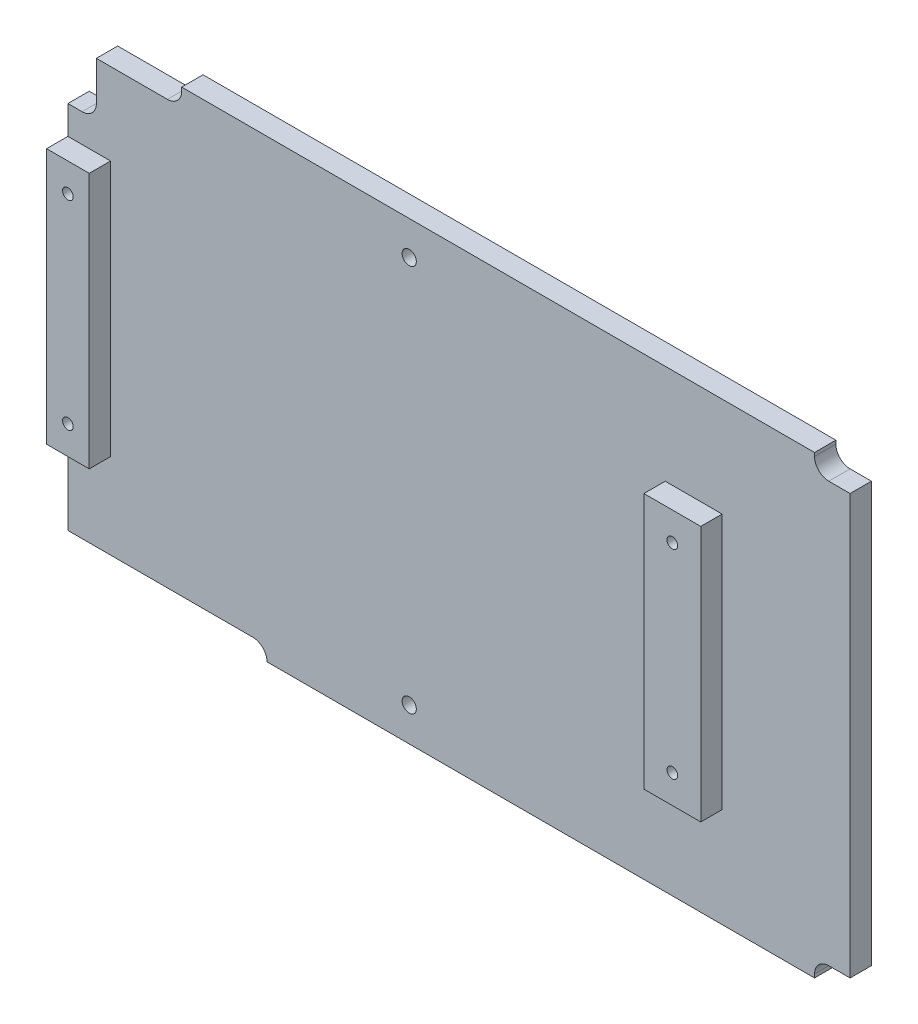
ISO-10303-21;
HEADER;
FILE_DESCRIPTION(('STEP AP214'),'2;1');
FILE_NAME('part.step','',(''),(''),'','','');
FILE_SCHEMA(('AUTOMOTIVE_DESIGN { 1 0 10303 214 1 1 1 1 }'));
ENDSEC;
DATA;
#1=APPLICATION_CONTEXT('core data for automotive mechanical design processes');
#2=APPLICATION_PROTOCOL_DEFINITION('international standard','automotive_design',2000,#1);
#3=PRODUCT_CONTEXT('',#1,'mechanical');
#4=PRODUCT('Part','Part','',(#3));
#5=PRODUCT_RELATED_PRODUCT_CATEGORY('part','',(#4));
#6=PRODUCT_DEFINITION_FORMATION('','',#4);
#7=PRODUCT_DEFINITION_CONTEXT('part definition',#1,'design');
#8=PRODUCT_DEFINITION('design','',#6,#7);
#9=PRODUCT_DEFINITION_SHAPE('','',#8);
#10=(LENGTH_UNIT() NAMED_UNIT(*) SI_UNIT(.MILLI.,.METRE.));
#11=(NAMED_UNIT(*) PLANE_ANGLE_UNIT() SI_UNIT($,.RADIAN.));
#12=(NAMED_UNIT(*) SI_UNIT($,.STERADIAN.) SOLID_ANGLE_UNIT());
#13=UNCERTAINTY_MEASURE_WITH_UNIT(LENGTH_MEASURE(1.E-05),#10,'distance_accuracy_value','');
#14=(GEOMETRIC_REPRESENTATION_CONTEXT(3) GLOBAL_UNCERTAINTY_ASSIGNED_CONTEXT((#13)) GLOBAL_UNIT_ASSIGNED_CONTEXT((#10,
#11,#12)) REPRESENTATION_CONTEXT('',''));
#15=CARTESIAN_POINT('',(0.,0.,0.));
#16=DIRECTION('',(0.,0.,1.));
#17=DIRECTION('',(1.,0.,0.));
#18=AXIS2_PLACEMENT_3D('',#15,#16,#17);
#19=CARTESIAN_POINT('',(0.,0.,19.05));
#20=DIRECTION('',(0.,0.,-1.));
#21=DIRECTION('',(-1.,0.,0.));
#22=AXIS2_PLACEMENT_3D('',#19,#20,#21);
#23=PLANE('',#22);
#24=CARTESIAN_POINT('',(9.52500000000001,-44.45,19.05));
#25=DIRECTION('',(0.,0.,1.));
#26=DIRECTION('',(1.,0.,0.));
#27=AXIS2_PLACEMENT_3D('',#24,#25,#26);
#28=CIRCLE('',#27,2.38760000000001);
#29=CARTESIAN_POINT('',(7.1374,-44.45,19.05));
#30=VERTEX_POINT('',#29);
#31=EDGE_CURVE('E118',#30,#30,#28,.T.);
#32=ORIENTED_EDGE('',*,*,#31,.F.);
#33=EDGE_LOOP('',(#32));
#34=FACE_BOUND('',#33,.T.);
#35=DIRECTION('',(0.,-1.,0.));
#36=VECTOR('',#35,1.);
#37=CARTESIAN_POINT('',(19.0499999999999,0.,19.05));
#38=LINE('',#37,#36);
#39=CARTESIAN_POINT('',(19.0499999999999,57.15,19.05));
#40=VERTEX_POINT('',#39);
#41=CARTESIAN_POINT('',(19.05,-57.15,19.05));
#42=VERTEX_POINT('',#41);
#43=EDGE_CURVE('E107',#40,#42,#38,.T.);
#44=ORIENTED_EDGE('',*,*,#43,.F.);
#45=DIRECTION('',(1.,0.,0.));
#46=VECTOR('',#45,1.);
#47=CARTESIAN_POINT('',(0.,57.15,19.05));
#48=LINE('',#47,#46);
#49=CARTESIAN_POINT('',(0.,57.15,19.05));
#50=VERTEX_POINT('',#49);
#51=EDGE_CURVE('E104',#50,#40,#48,.T.);
#52=ORIENTED_EDGE('',*,*,#51,.F.);
#53=DIRECTION('',(0.,1.,0.));
#54=VECTOR('',#53,1.);
#55=CARTESIAN_POINT('',(0.,0.,19.05));
#56=LINE('',#55,#54);
#57=CARTESIAN_POINT('',(0.,-57.15,19.05));
#58=VERTEX_POINT('',#57);
#59=EDGE_CURVE('E97',#58,#50,#56,.T.);
#60=ORIENTED_EDGE('',*,*,#59,.F.);
#61=DIRECTION('',(-1.,0.,0.));
#62=VECTOR('',#61,1.);
#63=CARTESIAN_POINT('',(0.,-57.15,19.05));
#64=LINE('',#63,#62);
#65=EDGE_CURVE('E103',#42,#58,#64,.T.);
#66=ORIENTED_EDGE('',*,*,#65,.F.);
#67=EDGE_LOOP('',(#44,#52,#60,#66));
#68=FACE_BOUND('',#67,.T.);
#69=CARTESIAN_POINT('',(9.52500000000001,44.45,19.05));
#70=DIRECTION('',(0.,0.,1.));
#71=DIRECTION('',(1.,0.,0.));
#72=AXIS2_PLACEMENT_3D('',#69,#70,#71);
#73=CIRCLE('',#72,2.38760000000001);
#74=CARTESIAN_POINT('',(7.1374,44.45,19.05));
#75=VERTEX_POINT('',#74);
#76=EDGE_CURVE('E156',#75,#75,#73,.T.);
#77=ORIENTED_EDGE('',*,*,#76,.F.);
#78=EDGE_LOOP('',(#77));
#79=FACE_BOUND('',#78,.T.);
#80=ADVANCED_FACE('F48',(#34,#68,#79),#23,.F.);
#81=CARTESIAN_POINT('',(0.,0.,9.525));
#82=DIRECTION('',(0.,0.,-1.));
#83=DIRECTION('',(-1.,0.,0.));
#84=AXIS2_PLACEMENT_3D('',#81,#82,#83);
#85=PLANE('',#84);
#86=CARTESIAN_POINT('',(9.52500000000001,-44.45,9.525));
#87=DIRECTION('',(0.,0.,1.));
#88=DIRECTION('',(1.,0.,0.));
#89=AXIS2_PLACEMENT_3D('',#86,#87,#88);
#90=CIRCLE('',#89,2.38760000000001);
#91=CARTESIAN_POINT('',(7.1374,-44.45,9.525));
#92=VERTEX_POINT('',#91);
#93=EDGE_CURVE('E161',#92,#92,#90,.T.);
#94=ORIENTED_EDGE('',*,*,#93,.T.);
#95=EDGE_LOOP('',(#94));
#96=FACE_BOUND('',#95,.T.);
#97=DIRECTION('',(0.,-1.,0.));
#98=VECTOR('',#97,1.);
#99=CARTESIAN_POINT('',(19.0499999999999,0.,9.525));
#100=LINE('',#99,#98);
#101=CARTESIAN_POINT('',(19.0499999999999,57.15,9.525));
#102=VERTEX_POINT('',#101);
#103=CARTESIAN_POINT('',(19.05,-57.15,9.525));
#104=VERTEX_POINT('',#103);
#105=EDGE_CURVE('E114',#102,#104,#100,.T.);
#106=ORIENTED_EDGE('',*,*,#105,.T.);
#107=DIRECTION('',(-1.,0.,0.));
#108=VECTOR('',#107,1.);
#109=CARTESIAN_POINT('',(0.,-57.15,9.525));
#110=LINE('',#109,#108);
#111=CARTESIAN_POINT('',(0.,-57.15,9.525));
#112=VERTEX_POINT('',#111);
#113=EDGE_CURVE('E117',#104,#112,#110,.T.);
#114=ORIENTED_EDGE('',*,*,#113,.T.);
#115=DIRECTION('',(0.,1.,0.));
#116=VECTOR('',#115,1.);
#117=CARTESIAN_POINT('',(0.,0.,9.525));
#118=LINE('',#117,#116);
#119=CARTESIAN_POINT('',(0.,57.15,9.525));
#120=VERTEX_POINT('',#119);
#121=EDGE_CURVE('E99',#112,#120,#118,.T.);
#122=ORIENTED_EDGE('',*,*,#121,.T.);
#123=DIRECTION('',(1.,0.,0.));
#124=VECTOR('',#123,1.);
#125=CARTESIAN_POINT('',(0.,57.15,9.525));
#126=LINE('',#125,#124);
#127=EDGE_CURVE('E109',#120,#102,#126,.T.);
#128=ORIENTED_EDGE('',*,*,#127,.T.);
#129=EDGE_LOOP('',(#106,#114,#122,#128));
#130=FACE_BOUND('',#129,.T.);
#131=CARTESIAN_POINT('',(9.52500000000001,44.45,9.525));
#132=DIRECTION('',(0.,0.,1.));
#133=DIRECTION('',(1.,0.,0.));
#134=AXIS2_PLACEMENT_3D('',#131,#132,#133);
#135=CIRCLE('',#134,2.38760000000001);
#136=CARTESIAN_POINT('',(7.1374,44.45,9.525));
#137=VERTEX_POINT('',#136);
#138=EDGE_CURVE('E159',#137,#137,#135,.T.);
#139=ORIENTED_EDGE('',*,*,#138,.T.);
#140=EDGE_LOOP('',(#139));
#141=FACE_BOUND('',#140,.T.);
#142=ADVANCED_FACE('F124',(#96,#130,#141),#85,.T.);
#143=CARTESIAN_POINT('',(19.0499999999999,0.,19.05));
#144=DIRECTION('',(1.,0.,0.));
#145=DIRECTION('',(0.,1.,0.));
#146=AXIS2_PLACEMENT_3D('',#143,#144,#145);
#147=PLANE('',#146);
#148=ORIENTED_EDGE('',*,*,#105,.F.);
#149=DIRECTION('',(0.,0.,-1.));
#150=VECTOR('',#149,1.);
#151=CARTESIAN_POINT('',(19.0499999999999,57.15,19.05));
#152=LINE('',#151,#150);
#153=EDGE_CURVE('E12',#40,#102,#152,.T.);
#154=ORIENTED_EDGE('',*,*,#153,.F.);
#155=ORIENTED_EDGE('',*,*,#43,.T.);
#156=DIRECTION('',(0.,0.,-1.));
#157=VECTOR('',#156,1.);
#158=CARTESIAN_POINT('',(19.05,-57.15,19.05));
#159=LINE('',#158,#157);
#160=EDGE_CURVE('E52',#42,#104,#159,.T.);
#161=ORIENTED_EDGE('',*,*,#160,.T.);
#162=EDGE_LOOP('',(#148,#154,#155,#161));
#163=FACE_BOUND('',#162,.T.);
#164=ADVANCED_FACE('F50',(#163),#147,.T.);
#165=CARTESIAN_POINT('',(0.,57.15,19.05));
#166=DIRECTION('',(0.,1.,0.));
#167=DIRECTION('',(0.,0.,1.));
#168=AXIS2_PLACEMENT_3D('',#165,#166,#167);
#169=PLANE('',#168);
#170=ORIENTED_EDGE('',*,*,#127,.F.);
#171=DIRECTION('',(0.,0.,-1.));
#172=VECTOR('',#171,1.);
#173=CARTESIAN_POINT('',(0.,57.15,19.05));
#174=LINE('',#173,#172);
#175=EDGE_CURVE('E58',#50,#120,#174,.T.);
#176=ORIENTED_EDGE('',*,*,#175,.F.);
#177=ORIENTED_EDGE('',*,*,#51,.T.);
#178=ORIENTED_EDGE('',*,*,#153,.T.);
#179=EDGE_LOOP('',(#170,#176,#177,#178));
#180=FACE_BOUND('',#179,.T.);
#181=ADVANCED_FACE('F126',(#180),#169,.T.);
#182=CARTESIAN_POINT('',(0.,0.,19.05));
#183=DIRECTION('',(-1.,0.,0.));
#184=DIRECTION('',(0.,0.,1.));
#185=AXIS2_PLACEMENT_3D('',#182,#183,#184);
#186=PLANE('',#185);
#187=ORIENTED_EDGE('',*,*,#121,.F.);
#188=DIRECTION('',(0.,0.,-1.));
#189=VECTOR('',#188,1.);
#190=CARTESIAN_POINT('',(0.,-57.15,19.05));
#191=LINE('',#190,#189);
#192=EDGE_CURVE('E94',#58,#112,#191,.T.);
#193=ORIENTED_EDGE('',*,*,#192,.F.);
#194=ORIENTED_EDGE('',*,*,#59,.T.);
#195=ORIENTED_EDGE('',*,*,#175,.T.);
#196=EDGE_LOOP('',(#187,#193,#194,#195));
#197=FACE_BOUND('',#196,.T.);
#198=ADVANCED_FACE('F96',(#197),#186,.T.);
#199=CARTESIAN_POINT('',(0.,-57.15,19.05));
#200=DIRECTION('',(0.,-1.,0.));
#201=DIRECTION('',(0.,0.,-1.));
#202=AXIS2_PLACEMENT_3D('',#199,#200,#201);
#203=PLANE('',#202);
#204=ORIENTED_EDGE('',*,*,#113,.F.);
#205=ORIENTED_EDGE('',*,*,#160,.F.);
#206=ORIENTED_EDGE('',*,*,#65,.T.);
#207=ORIENTED_EDGE('',*,*,#192,.T.);
#208=EDGE_LOOP('',(#204,#205,#206,#207));
#209=FACE_BOUND('',#208,.T.);
#210=ADVANCED_FACE('F106',(#209),#203,.T.);
#211=CARTESIAN_POINT('',(9.52500000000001,-44.45,19.05));
#212=DIRECTION('',(0.,0.,-1.));
#213=DIRECTION('',(-1.,0.,0.));
#214=AXIS2_PLACEMENT_3D('',#211,#212,#213);
#215=CYLINDRICAL_SURFACE('',#214,2.38760000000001);
#216=CARTESIAN_POINT('',(7.1374,-44.45,19.05));
#217=CARTESIAN_POINT('',(7.1374,-44.45,18.95078125));
#218=CARTESIAN_POINT('',(7.1374,-44.45,18.8515625));
#219=CARTESIAN_POINT('',(7.1374,-44.45,18.653125));
#220=CARTESIAN_POINT('',(7.1374,-44.45,18.55390625));
#221=CARTESIAN_POINT('',(7.1374,-44.45,18.35546875));
#222=CARTESIAN_POINT('',(7.1374,-44.45,18.25625));
#223=CARTESIAN_POINT('',(7.1374,-44.45,18.0578125));
#224=CARTESIAN_POINT('',(7.1374,-44.45,17.95859375));
#225=CARTESIAN_POINT('',(7.1374,-44.45,17.76015625));
#226=CARTESIAN_POINT('',(7.1374,-44.45,17.6609375));
#227=CARTESIAN_POINT('',(7.1374,-44.45,17.4625));
#228=CARTESIAN_POINT('',(7.1374,-44.45,17.36328125));
#229=CARTESIAN_POINT('',(7.1374,-44.45,17.16484375));
#230=CARTESIAN_POINT('',(7.1374,-44.45,17.065625));
#231=CARTESIAN_POINT('',(7.1374,-44.45,16.8671875));
#232=CARTESIAN_POINT('',(7.1374,-44.45,16.76796875));
#233=CARTESIAN_POINT('',(7.1374,-44.45,16.56953125));
#234=CARTESIAN_POINT('',(7.1374,-44.45,16.4703125));
#235=CARTESIAN_POINT('',(7.1374,-44.45,16.271875));
#236=CARTESIAN_POINT('',(7.1374,-44.45,16.17265625));
#237=CARTESIAN_POINT('',(7.1374,-44.45,15.97421875));
#238=CARTESIAN_POINT('',(7.1374,-44.45,15.875));
#239=CARTESIAN_POINT('',(7.1374,-44.45,15.6765625));
#240=CARTESIAN_POINT('',(7.1374,-44.45,15.57734375));
#241=CARTESIAN_POINT('',(7.1374,-44.45,15.37890625));
#242=CARTESIAN_POINT('',(7.1374,-44.45,15.2796875));
#243=CARTESIAN_POINT('',(7.1374,-44.45,15.08125));
#244=CARTESIAN_POINT('',(7.1374,-44.45,14.98203125));
#245=CARTESIAN_POINT('',(7.1374,-44.45,14.78359375));
#246=CARTESIAN_POINT('',(7.1374,-44.45,14.684375));
#247=CARTESIAN_POINT('',(7.1374,-44.45,14.4859375));
#248=CARTESIAN_POINT('',(7.1374,-44.45,14.38671875));
#249=CARTESIAN_POINT('',(7.1374,-44.45,14.18828125));
#250=CARTESIAN_POINT('',(7.1374,-44.45,14.0890625));
#251=CARTESIAN_POINT('',(7.1374,-44.45,13.890625));
#252=CARTESIAN_POINT('',(7.1374,-44.45,13.79140625));
#253=CARTESIAN_POINT('',(7.1374,-44.45,13.59296875));
#254=CARTESIAN_POINT('',(7.1374,-44.45,13.49375));
#255=CARTESIAN_POINT('',(7.1374,-44.45,13.2953125));
#256=CARTESIAN_POINT('',(7.1374,-44.45,13.19609375));
#257=CARTESIAN_POINT('',(7.1374,-44.45,12.99765625));
#258=CARTESIAN_POINT('',(7.1374,-44.45,12.8984375));
#259=CARTESIAN_POINT('',(7.1374,-44.45,12.7));
#260=CARTESIAN_POINT('',(7.1374,-44.45,12.60078125));
#261=CARTESIAN_POINT('',(7.1374,-44.45,12.40234375));
#262=CARTESIAN_POINT('',(7.1374,-44.45,12.303125));
#263=CARTESIAN_POINT('',(7.1374,-44.45,12.1046875));
#264=CARTESIAN_POINT('',(7.1374,-44.45,12.00546875));
#265=CARTESIAN_POINT('',(7.1374,-44.45,11.80703125));
#266=CARTESIAN_POINT('',(7.1374,-44.45,11.7078125));
#267=CARTESIAN_POINT('',(7.1374,-44.45,11.509375));
#268=CARTESIAN_POINT('',(7.1374,-44.45,11.41015625));
#269=CARTESIAN_POINT('',(7.1374,-44.45,11.21171875));
#270=CARTESIAN_POINT('',(7.1374,-44.45,11.1125));
#271=CARTESIAN_POINT('',(7.1374,-44.45,10.9140625));
#272=CARTESIAN_POINT('',(7.1374,-44.45,10.81484375));
#273=CARTESIAN_POINT('',(7.1374,-44.45,10.61640625));
#274=CARTESIAN_POINT('',(7.1374,-44.45,10.5171875));
#275=CARTESIAN_POINT('',(7.1374,-44.45,10.31875));
#276=CARTESIAN_POINT('',(7.1374,-44.45,10.21953125));
#277=CARTESIAN_POINT('',(7.1374,-44.45,10.02109375));
#278=CARTESIAN_POINT('',(7.1374,-44.45,9.921875));
#279=CARTESIAN_POINT('',(7.1374,-44.45,9.7234375));
#280=CARTESIAN_POINT('',(7.1374,-44.45,9.62421875));
#281=CARTESIAN_POINT('',(7.1374,-44.45,9.525));
#282=B_SPLINE_CURVE_WITH_KNOTS('',3,(#216,#217,#218,#219,#220,#221,#222,#223,#224,#225,#226,
#227,#228,#229,#230,#231,#232,#233,#234,#235,#236,#237,#238,#239,#240,#241,#242,#243,#244,#245,
#246,#247,#248,#249,#250,#251,#252,#253,#254,#255,#256,#257,#258,#259,#260,#261,#262,#263,#264,
#265,#266,#267,#268,#269,#270,#271,#272,#273,#274,#275,#276,#277,#278,#279,#280,#281),
.UNSPECIFIED.,.F.,.F.,(4,2,2,2,2,2,2,2,2,2,2,2,2,2,2,2,2,2,2,2,2,2,2,2,2,2,2,2,2,2,2,2,4),(0.,
0.297656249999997,0.595312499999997,0.892968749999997,1.190625,1.48828125,1.7859375,2.08359375,
2.38125,2.67890625,2.9765625,3.27421875,3.571875,3.86953125,4.1671875,4.46484375,4.7625,
5.06015625,5.3578125,5.65546875,5.953125,6.25078125,6.5484375,6.84609375,7.14375,7.44140625,
7.7390625,8.03671875,8.334375,8.63203125,8.9296875,9.22734375,9.525),.UNSPECIFIED.);
#283=EDGE_CURVE('BSEAM144',#30,#92,#282,.T.);
#284=ORIENTED_EDGE('',*,*,#31,.T.);
#285=ORIENTED_EDGE('',*,*,#93,.F.);
#286=ORIENTED_EDGE('',*,*,#283,.T.);
#287=ORIENTED_EDGE('',*,*,#283,.F.);
#288=EDGE_LOOP('',(#284,#286,#285,#287));
#289=FACE_BOUND('',#288,.T.);
#290=ADVANCED_FACE('F144',(#289),#215,.F.);
#291=CARTESIAN_POINT('',(9.52500000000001,44.45,19.05));
#292=DIRECTION('',(0.,0.,-1.));
#293=DIRECTION('',(-1.,0.,0.));
#294=AXIS2_PLACEMENT_3D('',#291,#292,#293);
#295=CYLINDRICAL_SURFACE('',#294,2.38760000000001);
#296=CARTESIAN_POINT('',(7.1374,44.45,19.05));
#297=CARTESIAN_POINT('',(7.1374,44.45,18.95078125));
#298=CARTESIAN_POINT('',(7.1374,44.45,18.8515625));
#299=CARTESIAN_POINT('',(7.1374,44.45,18.653125));
#300=CARTESIAN_POINT('',(7.1374,44.45,18.55390625));
#301=CARTESIAN_POINT('',(7.1374,44.45,18.35546875));
#302=CARTESIAN_POINT('',(7.1374,44.45,18.25625));
#303=CARTESIAN_POINT('',(7.1374,44.45,18.0578125));
#304=CARTESIAN_POINT('',(7.1374,44.45,17.95859375));
#305=CARTESIAN_POINT('',(7.1374,44.45,17.76015625));
#306=CARTESIAN_POINT('',(7.1374,44.45,17.6609375));
#307=CARTESIAN_POINT('',(7.1374,44.45,17.4625));
#308=CARTESIAN_POINT('',(7.1374,44.45,17.36328125));
#309=CARTESIAN_POINT('',(7.1374,44.45,17.16484375));
#310=CARTESIAN_POINT('',(7.1374,44.45,17.065625));
#311=CARTESIAN_POINT('',(7.1374,44.45,16.8671875));
#312=CARTESIAN_POINT('',(7.1374,44.45,16.76796875));
#313=CARTESIAN_POINT('',(7.1374,44.45,16.56953125));
#314=CARTESIAN_POINT('',(7.1374,44.45,16.4703125));
#315=CARTESIAN_POINT('',(7.1374,44.45,16.271875));
#316=CARTESIAN_POINT('',(7.1374,44.45,16.17265625));
#317=CARTESIAN_POINT('',(7.1374,44.45,15.97421875));
#318=CARTESIAN_POINT('',(7.1374,44.45,15.875));
#319=CARTESIAN_POINT('',(7.1374,44.45,15.6765625));
#320=CARTESIAN_POINT('',(7.1374,44.45,15.57734375));
#321=CARTESIAN_POINT('',(7.1374,44.45,15.37890625));
#322=CARTESIAN_POINT('',(7.1374,44.45,15.2796875));
#323=CARTESIAN_POINT('',(7.1374,44.45,15.08125));
#324=CARTESIAN_POINT('',(7.1374,44.45,14.98203125));
#325=CARTESIAN_POINT('',(7.1374,44.45,14.78359375));
#326=CARTESIAN_POINT('',(7.1374,44.45,14.684375));
#327=CARTESIAN_POINT('',(7.1374,44.45,14.4859375));
#328=CARTESIAN_POINT('',(7.1374,44.45,14.38671875));
#329=CARTESIAN_POINT('',(7.1374,44.45,14.18828125));
#330=CARTESIAN_POINT('',(7.1374,44.45,14.0890625));
#331=CARTESIAN_POINT('',(7.1374,44.45,13.890625));
#332=CARTESIAN_POINT('',(7.1374,44.45,13.79140625));
#333=CARTESIAN_POINT('',(7.1374,44.45,13.59296875));
#334=CARTESIAN_POINT('',(7.1374,44.45,13.49375));
#335=CARTESIAN_POINT('',(7.1374,44.45,13.2953125));
#336=CARTESIAN_POINT('',(7.1374,44.45,13.19609375));
#337=CARTESIAN_POINT('',(7.1374,44.45,12.99765625));
#338=CARTESIAN_POINT('',(7.1374,44.45,12.8984375));
#339=CARTESIAN_POINT('',(7.1374,44.45,12.7));
#340=CARTESIAN_POINT('',(7.1374,44.45,12.60078125));
#341=CARTESIAN_POINT('',(7.1374,44.45,12.40234375));
#342=CARTESIAN_POINT('',(7.1374,44.45,12.303125));
#343=CARTESIAN_POINT('',(7.1374,44.45,12.1046875));
#344=CARTESIAN_POINT('',(7.1374,44.45,12.00546875));
#345=CARTESIAN_POINT('',(7.1374,44.45,11.80703125));
#346=CARTESIAN_POINT('',(7.1374,44.45,11.7078125));
#347=CARTESIAN_POINT('',(7.1374,44.45,11.509375));
#348=CARTESIAN_POINT('',(7.1374,44.45,11.41015625));
#349=CARTESIAN_POINT('',(7.1374,44.45,11.21171875));
#350=CARTESIAN_POINT('',(7.1374,44.45,11.1125));
#351=CARTESIAN_POINT('',(7.1374,44.45,10.9140625));
#352=CARTESIAN_POINT('',(7.1374,44.45,10.81484375));
#353=CARTESIAN_POINT('',(7.1374,44.45,10.61640625));
#354=CARTESIAN_POINT('',(7.1374,44.45,10.5171875));
#355=CARTESIAN_POINT('',(7.1374,44.45,10.31875));
#356=CARTESIAN_POINT('',(7.1374,44.45,10.21953125));
#357=CARTESIAN_POINT('',(7.1374,44.45,10.02109375));
#358=CARTESIAN_POINT('',(7.1374,44.45,9.921875));
#359=CARTESIAN_POINT('',(7.1374,44.45,9.7234375));
#360=CARTESIAN_POINT('',(7.1374,44.45,9.62421875));
#361=CARTESIAN_POINT('',(7.1374,44.45,9.525));
#362=B_SPLINE_CURVE_WITH_KNOTS('',3,(#296,#297,#298,#299,#300,#301,#302,#303,#304,#305,#306,
#307,#308,#309,#310,#311,#312,#313,#314,#315,#316,#317,#318,#319,#320,#321,#322,#323,#324,#325,
#326,#327,#328,#329,#330,#331,#332,#333,#334,#335,#336,#337,#338,#339,#340,#341,#342,#343,#344,
#345,#346,#347,#348,#349,#350,#351,#352,#353,#354,#355,#356,#357,#358,#359,#360,#361),
.UNSPECIFIED.,.F.,.F.,(4,2,2,2,2,2,2,2,2,2,2,2,2,2,2,2,2,2,2,2,2,2,2,2,2,2,2,2,2,2,2,2,4),(0.,
0.297656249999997,0.595312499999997,0.892968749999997,1.190625,1.48828125,1.7859375,2.08359375,
2.38125,2.67890625,2.9765625,3.27421875,3.571875,3.86953125,4.1671875,4.46484375,4.7625,
5.06015625,5.3578125,5.65546875,5.953125,6.25078125,6.5484375,6.84609375,7.14375,7.44140625,
7.7390625,8.03671875,8.334375,8.63203125,8.9296875,9.22734375,9.525),.UNSPECIFIED.);
#363=EDGE_CURVE('BSEAM147',#75,#137,#362,.T.);
#364=ORIENTED_EDGE('',*,*,#76,.T.);
#365=ORIENTED_EDGE('',*,*,#138,.F.);
#366=ORIENTED_EDGE('',*,*,#363,.T.);
#367=ORIENTED_EDGE('',*,*,#363,.F.);
#368=EDGE_LOOP('',(#364,#366,#365,#367));
#369=FACE_BOUND('',#368,.T.);
#370=ADVANCED_FACE('F147',(#369),#295,.F.);
#371=CLOSED_SHELL('',(#80,#142,#164,#181,#198,#210,#290,#370));
#372=MANIFOLD_SOLID_BREP('B2',#371);
#373=CARTESIAN_POINT('',(0.,0.,19.05));
#374=DIRECTION('',(0.,0.,-1.));
#375=DIRECTION('',(-1.,0.,0.));
#376=AXIS2_PLACEMENT_3D('',#373,#374,#375);
#377=PLANE('',#376);
#378=CARTESIAN_POINT('',(279.4,-44.45,19.05));
#379=DIRECTION('',(0.,0.,1.));
#380=DIRECTION('',(1.,0.,0.));
#381=AXIS2_PLACEMENT_3D('',#378,#379,#380);
#382=CIRCLE('',#381,2.38759999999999);
#383=CARTESIAN_POINT('',(277.0124,-44.45,19.05));
#384=VERTEX_POINT('',#383);
#385=EDGE_CURVE('E293',#384,#384,#382,.T.);
#386=ORIENTED_EDGE('',*,*,#385,.F.);
#387=EDGE_LOOP('',(#386));
#388=FACE_BOUND('',#387,.T.);
#389=DIRECTION('',(0.,-1.,0.));
#390=VECTOR('',#389,1.);
#391=CARTESIAN_POINT('',(292.1,0.,19.05));
#392=LINE('',#391,#390);
#393=CARTESIAN_POINT('',(292.1,57.15,19.05));
#394=VERTEX_POINT('',#393);
#395=CARTESIAN_POINT('',(292.1,-57.15,19.05));
#396=VERTEX_POINT('',#395);
#397=EDGE_CURVE('E282',#394,#396,#392,.T.);
#398=ORIENTED_EDGE('',*,*,#397,.F.);
#399=DIRECTION('',(1.,0.,0.));
#400=VECTOR('',#399,1.);
#401=CARTESIAN_POINT('',(0.,57.15,19.05));
#402=LINE('',#401,#400);
#403=CARTESIAN_POINT('',(266.7,57.15,19.05));
#404=VERTEX_POINT('',#403);
#405=EDGE_CURVE('E279',#404,#394,#402,.T.);
#406=ORIENTED_EDGE('',*,*,#405,.F.);
#407=DIRECTION('',(0.,1.,0.));
#408=VECTOR('',#407,1.);
#409=CARTESIAN_POINT('',(266.7,0.,19.05));
#410=LINE('',#409,#408);
#411=CARTESIAN_POINT('',(266.7,-57.15,19.05));
#412=VERTEX_POINT('',#411);
#413=EDGE_CURVE('E272',#412,#404,#410,.T.);
#414=ORIENTED_EDGE('',*,*,#413,.F.);
#415=DIRECTION('',(-1.,0.,0.));
#416=VECTOR('',#415,1.);
#417=CARTESIAN_POINT('',(0.,-57.15,19.05));
#418=LINE('',#417,#416);
#419=EDGE_CURVE('E278',#396,#412,#418,.T.);
#420=ORIENTED_EDGE('',*,*,#419,.F.);
#421=EDGE_LOOP('',(#398,#406,#414,#420));
#422=FACE_BOUND('',#421,.T.);
#423=CARTESIAN_POINT('',(279.4,44.45,19.05));
#424=DIRECTION('',(0.,0.,1.));
#425=DIRECTION('',(1.,0.,0.));
#426=AXIS2_PLACEMENT_3D('',#423,#424,#425);
#427=CIRCLE('',#426,2.38759999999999);
#428=CARTESIAN_POINT('',(277.0124,44.45,19.05));
#429=VERTEX_POINT('',#428);
#430=EDGE_CURVE('E331',#429,#429,#427,.T.);
#431=ORIENTED_EDGE('',*,*,#430,.F.);
#432=EDGE_LOOP('',(#431));
#433=FACE_BOUND('',#432,.T.);
#434=ADVANCED_FACE('F223',(#388,#422,#433),#377,.F.);
#435=CARTESIAN_POINT('',(0.,0.,9.525));
#436=DIRECTION('',(0.,0.,-1.));
#437=DIRECTION('',(-1.,0.,0.));
#438=AXIS2_PLACEMENT_3D('',#435,#436,#437);
#439=PLANE('',#438);
#440=CARTESIAN_POINT('',(279.4,-44.45,9.525));
#441=DIRECTION('',(0.,0.,1.));
#442=DIRECTION('',(1.,0.,0.));
#443=AXIS2_PLACEMENT_3D('',#440,#441,#442);
#444=CIRCLE('',#443,2.38759999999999);
#445=CARTESIAN_POINT('',(277.0124,-44.45,9.525));
#446=VERTEX_POINT('',#445);
#447=EDGE_CURVE('E336',#446,#446,#444,.T.);
#448=ORIENTED_EDGE('',*,*,#447,.T.);
#449=EDGE_LOOP('',(#448));
#450=FACE_BOUND('',#449,.T.);
#451=DIRECTION('',(0.,-1.,0.));
#452=VECTOR('',#451,1.);
#453=CARTESIAN_POINT('',(292.1,0.,9.525));
#454=LINE('',#453,#452);
#455=CARTESIAN_POINT('',(292.1,57.15,9.525));
#456=VERTEX_POINT('',#455);
#457=CARTESIAN_POINT('',(292.1,-57.15,9.525));
#458=VERTEX_POINT('',#457);
#459=EDGE_CURVE('E289',#456,#458,#454,.T.);
#460=ORIENTED_EDGE('',*,*,#459,.T.);
#461=DIRECTION('',(-1.,0.,0.));
#462=VECTOR('',#461,1.);
#463=CARTESIAN_POINT('',(0.,-57.15,9.525));
#464=LINE('',#463,#462);
#465=CARTESIAN_POINT('',(266.7,-57.15,9.525));
#466=VERTEX_POINT('',#465);
#467=EDGE_CURVE('E292',#458,#466,#464,.T.);
#468=ORIENTED_EDGE('',*,*,#467,.T.);
#469=DIRECTION('',(0.,1.,0.));
#470=VECTOR('',#469,1.);
#471=CARTESIAN_POINT('',(266.7,0.,9.525));
#472=LINE('',#471,#470);
#473=CARTESIAN_POINT('',(266.7,57.15,9.525));
#474=VERTEX_POINT('',#473);
#475=EDGE_CURVE('E274',#466,#474,#472,.T.);
#476=ORIENTED_EDGE('',*,*,#475,.T.);
#477=DIRECTION('',(1.,0.,0.));
#478=VECTOR('',#477,1.);
#479=CARTESIAN_POINT('',(0.,57.15,9.525));
#480=LINE('',#479,#478);
#481=EDGE_CURVE('E284',#474,#456,#480,.T.);
#482=ORIENTED_EDGE('',*,*,#481,.T.);
#483=EDGE_LOOP('',(#460,#468,#476,#482));
#484=FACE_BOUND('',#483,.T.);
#485=CARTESIAN_POINT('',(279.4,44.45,9.525));
#486=DIRECTION('',(0.,0.,1.));
#487=DIRECTION('',(1.,0.,0.));
#488=AXIS2_PLACEMENT_3D('',#485,#486,#487);
#489=CIRCLE('',#488,2.38759999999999);
#490=CARTESIAN_POINT('',(277.0124,44.45,9.525));
#491=VERTEX_POINT('',#490);
#492=EDGE_CURVE('E334',#491,#491,#489,.T.);
#493=ORIENTED_EDGE('',*,*,#492,.T.);
#494=EDGE_LOOP('',(#493));
#495=FACE_BOUND('',#494,.T.);
#496=ADVANCED_FACE('F299',(#450,#484,#495),#439,.T.);
#497=CARTESIAN_POINT('',(292.1,0.,19.05));
#498=DIRECTION('',(1.,0.,0.));
#499=DIRECTION('',(0.,0.,-1.));
#500=AXIS2_PLACEMENT_3D('',#497,#498,#499);
#501=PLANE('',#500);
#502=ORIENTED_EDGE('',*,*,#459,.F.);
#503=DIRECTION('',(0.,0.,-1.));
#504=VECTOR('',#503,1.);
#505=CARTESIAN_POINT('',(292.1,57.15,19.05));
#506=LINE('',#505,#504);
#507=EDGE_CURVE('E46',#394,#456,#506,.T.);
#508=ORIENTED_EDGE('',*,*,#507,.F.);
#509=ORIENTED_EDGE('',*,*,#397,.T.);
#510=DIRECTION('',(0.,0.,-1.));
#511=VECTOR('',#510,1.);
#512=CARTESIAN_POINT('',(292.1,-57.15,19.05));
#513=LINE('',#512,#511);
#514=EDGE_CURVE('E227',#396,#458,#513,.T.);
#515=ORIENTED_EDGE('',*,*,#514,.T.);
#516=EDGE_LOOP('',(#502,#508,#509,#515));
#517=FACE_BOUND('',#516,.T.);
#518=ADVANCED_FACE('F225',(#517),#501,.T.);
#519=CARTESIAN_POINT('',(0.,57.15,19.05));
#520=DIRECTION('',(0.,1.,0.));
#521=DIRECTION('',(0.,0.,1.));
#522=AXIS2_PLACEMENT_3D('',#519,#520,#521);
#523=PLANE('',#522);
#524=ORIENTED_EDGE('',*,*,#481,.F.);
#525=DIRECTION('',(0.,0.,-1.));
#526=VECTOR('',#525,1.);
#527=CARTESIAN_POINT('',(266.7,57.15,19.05));
#528=LINE('',#527,#526);
#529=EDGE_CURVE('E233',#404,#474,#528,.T.);
#530=ORIENTED_EDGE('',*,*,#529,.F.);
#531=ORIENTED_EDGE('',*,*,#405,.T.);
#532=ORIENTED_EDGE('',*,*,#507,.T.);
#533=EDGE_LOOP('',(#524,#530,#531,#532));
#534=FACE_BOUND('',#533,.T.);
#535=ADVANCED_FACE('F301',(#534),#523,.T.);
#536=CARTESIAN_POINT('',(266.7,0.,19.05));
#537=DIRECTION('',(-1.,0.,0.));
#538=DIRECTION('',(0.,0.,1.));
#539=AXIS2_PLACEMENT_3D('',#536,#537,#538);
#540=PLANE('',#539);
#541=ORIENTED_EDGE('',*,*,#475,.F.);
#542=DIRECTION('',(0.,0.,-1.));
#543=VECTOR('',#542,1.);
#544=CARTESIAN_POINT('',(266.7,-57.15,19.05));
#545=LINE('',#544,#543);
#546=EDGE_CURVE('E269',#412,#466,#545,.T.);
#547=ORIENTED_EDGE('',*,*,#546,.F.);
#548=ORIENTED_EDGE('',*,*,#413,.T.);
#549=ORIENTED_EDGE('',*,*,#529,.T.);
#550=EDGE_LOOP('',(#541,#547,#548,#549));
#551=FACE_BOUND('',#550,.T.);
#552=ADVANCED_FACE('F271',(#551),#540,.T.);
#553=CARTESIAN_POINT('',(0.,-57.15,19.05));
#554=DIRECTION('',(0.,-1.,0.));
#555=DIRECTION('',(0.,0.,-1.));
#556=AXIS2_PLACEMENT_3D('',#553,#554,#555);
#557=PLANE('',#556);
#558=ORIENTED_EDGE('',*,*,#467,.F.);
#559=ORIENTED_EDGE('',*,*,#514,.F.);
#560=ORIENTED_EDGE('',*,*,#419,.T.);
#561=ORIENTED_EDGE('',*,*,#546,.T.);
#562=EDGE_LOOP('',(#558,#559,#560,#561));
#563=FACE_BOUND('',#562,.T.);
#564=ADVANCED_FACE('F281',(#563),#557,.T.);
#565=CARTESIAN_POINT('',(279.4,-44.45,19.05));
#566=DIRECTION('',(0.,0.,-1.));
#567=DIRECTION('',(-1.,0.,0.));
#568=AXIS2_PLACEMENT_3D('',#565,#566,#567);
#569=CYLINDRICAL_SURFACE('',#568,2.38759999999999);
#570=CARTESIAN_POINT('',(277.0124,-44.45,19.05));
#571=CARTESIAN_POINT('',(277.0124,-44.45,18.95078125));
#572=CARTESIAN_POINT('',(277.0124,-44.45,18.8515625));
#573=CARTESIAN_POINT('',(277.0124,-44.45,18.653125));
#574=CARTESIAN_POINT('',(277.0124,-44.45,18.55390625));
#575=CARTESIAN_POINT('',(277.0124,-44.45,18.35546875));
#576=CARTESIAN_POINT('',(277.0124,-44.45,18.25625));
#577=CARTESIAN_POINT('',(277.0124,-44.45,18.0578125));
#578=CARTESIAN_POINT('',(277.0124,-44.45,17.95859375));
#579=CARTESIAN_POINT('',(277.0124,-44.45,17.76015625));
#580=CARTESIAN_POINT('',(277.0124,-44.45,17.6609375));
#581=CARTESIAN_POINT('',(277.0124,-44.45,17.4625));
#582=CARTESIAN_POINT('',(277.0124,-44.45,17.36328125));
#583=CARTESIAN_POINT('',(277.0124,-44.45,17.16484375));
#584=CARTESIAN_POINT('',(277.0124,-44.45,17.065625));
#585=CARTESIAN_POINT('',(277.0124,-44.45,16.8671875));
#586=CARTESIAN_POINT('',(277.0124,-44.45,16.76796875));
#587=CARTESIAN_POINT('',(277.0124,-44.45,16.56953125));
#588=CARTESIAN_POINT('',(277.0124,-44.45,16.4703125));
#589=CARTESIAN_POINT('',(277.0124,-44.45,16.271875));
#590=CARTESIAN_POINT('',(277.0124,-44.45,16.17265625));
#591=CARTESIAN_POINT('',(277.0124,-44.45,15.97421875));
#592=CARTESIAN_POINT('',(277.0124,-44.45,15.875));
#593=CARTESIAN_POINT('',(277.0124,-44.45,15.6765625));
#594=CARTESIAN_POINT('',(277.0124,-44.45,15.57734375));
#595=CARTESIAN_POINT('',(277.0124,-44.45,15.37890625));
#596=CARTESIAN_POINT('',(277.0124,-44.45,15.2796875));
#597=CARTESIAN_POINT('',(277.0124,-44.45,15.08125));
#598=CARTESIAN_POINT('',(277.0124,-44.45,14.98203125));
#599=CARTESIAN_POINT('',(277.0124,-44.45,14.78359375));
#600=CARTESIAN_POINT('',(277.0124,-44.45,14.684375));
#601=CARTESIAN_POINT('',(277.0124,-44.45,14.4859375));
#602=CARTESIAN_POINT('',(277.0124,-44.45,14.38671875));
#603=CARTESIAN_POINT('',(277.0124,-44.45,14.18828125));
#604=CARTESIAN_POINT('',(277.0124,-44.45,14.0890625));
#605=CARTESIAN_POINT('',(277.0124,-44.45,13.890625));
#606=CARTESIAN_POINT('',(277.0124,-44.45,13.79140625));
#607=CARTESIAN_POINT('',(277.0124,-44.45,13.59296875));
#608=CARTESIAN_POINT('',(277.0124,-44.45,13.49375));
#609=CARTESIAN_POINT('',(277.0124,-44.45,13.2953125));
#610=CARTESIAN_POINT('',(277.0124,-44.45,13.19609375));
#611=CARTESIAN_POINT('',(277.0124,-44.45,12.99765625));
#612=CARTESIAN_POINT('',(277.0124,-44.45,12.8984375));
#613=CARTESIAN_POINT('',(277.0124,-44.45,12.7));
#614=CARTESIAN_POINT('',(277.0124,-44.45,12.60078125));
#615=CARTESIAN_POINT('',(277.0124,-44.45,12.40234375));
#616=CARTESIAN_POINT('',(277.0124,-44.45,12.303125));
#617=CARTESIAN_POINT('',(277.0124,-44.45,12.1046875));
#618=CARTESIAN_POINT('',(277.0124,-44.45,12.00546875));
#619=CARTESIAN_POINT('',(277.0124,-44.45,11.80703125));
#620=CARTESIAN_POINT('',(277.0124,-44.45,11.7078125));
#621=CARTESIAN_POINT('',(277.0124,-44.45,11.509375));
#622=CARTESIAN_POINT('',(277.0124,-44.45,11.41015625));
#623=CARTESIAN_POINT('',(277.0124,-44.45,11.21171875));
#624=CARTESIAN_POINT('',(277.0124,-44.45,11.1125));
#625=CARTESIAN_POINT('',(277.0124,-44.45,10.9140625));
#626=CARTESIAN_POINT('',(277.0124,-44.45,10.81484375));
#627=CARTESIAN_POINT('',(277.0124,-44.45,10.61640625));
#628=CARTESIAN_POINT('',(277.0124,-44.45,10.5171875));
#629=CARTESIAN_POINT('',(277.0124,-44.45,10.31875));
#630=CARTESIAN_POINT('',(277.0124,-44.45,10.21953125));
#631=CARTESIAN_POINT('',(277.0124,-44.45,10.02109375));
#632=CARTESIAN_POINT('',(277.0124,-44.45,9.921875));
#633=CARTESIAN_POINT('',(277.0124,-44.45,9.7234375));
#634=CARTESIAN_POINT('',(277.0124,-44.45,9.62421875));
#635=CARTESIAN_POINT('',(277.0124,-44.45,9.525));
#636=B_SPLINE_CURVE_WITH_KNOTS('',3,(#570,#571,#572,#573,#574,#575,#576,#577,#578,#579,#580,
#581,#582,#583,#584,#585,#586,#587,#588,#589,#590,#591,#592,#593,#594,#595,#596,#597,#598,#599,
#600,#601,#602,#603,#604,#605,#606,#607,#608,#609,#610,#611,#612,#613,#614,#615,#616,#617,#618,
#619,#620,#621,#622,#623,#624,#625,#626,#627,#628,#629,#630,#631,#632,#633,#634,#635),
.UNSPECIFIED.,.F.,.F.,(4,2,2,2,2,2,2,2,2,2,2,2,2,2,2,2,2,2,2,2,2,2,2,2,2,2,2,2,2,2,2,2,4),(0.,
0.297656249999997,0.595312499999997,0.892968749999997,1.190625,1.48828125,1.7859375,2.08359375,
2.38125,2.67890625,2.9765625,3.27421875,3.571875,3.86953125,4.1671875,4.46484375,4.7625,
5.06015625,5.3578125,5.65546875,5.953125,6.25078125,6.5484375,6.84609375,7.14375,7.44140625,
7.7390625,8.03671875,8.334375,8.63203125,8.9296875,9.22734375,9.525),.UNSPECIFIED.);
#637=EDGE_CURVE('BSEAM319',#384,#446,#636,.T.);
#638=ORIENTED_EDGE('',*,*,#385,.T.);
#639=ORIENTED_EDGE('',*,*,#447,.F.);
#640=ORIENTED_EDGE('',*,*,#637,.T.);
#641=ORIENTED_EDGE('',*,*,#637,.F.);
#642=EDGE_LOOP('',(#638,#640,#639,#641));
#643=FACE_BOUND('',#642,.T.);
#644=ADVANCED_FACE('F319',(#643),#569,.F.);
#645=CARTESIAN_POINT('',(279.4,44.45,19.05));
#646=DIRECTION('',(0.,0.,-1.));
#647=DIRECTION('',(-1.,0.,0.));
#648=AXIS2_PLACEMENT_3D('',#645,#646,#647);
#649=CYLINDRICAL_SURFACE('',#648,2.38759999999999);
#650=CARTESIAN_POINT('',(277.0124,44.45,19.05));
#651=CARTESIAN_POINT('',(277.0124,44.45,18.95078125));
#652=CARTESIAN_POINT('',(277.0124,44.45,18.8515625));
#653=CARTESIAN_POINT('',(277.0124,44.45,18.653125));
#654=CARTESIAN_POINT('',(277.0124,44.45,18.55390625));
#655=CARTESIAN_POINT('',(277.0124,44.45,18.35546875));
#656=CARTESIAN_POINT('',(277.0124,44.45,18.25625));
#657=CARTESIAN_POINT('',(277.0124,44.45,18.0578125));
#658=CARTESIAN_POINT('',(277.0124,44.45,17.95859375));
#659=CARTESIAN_POINT('',(277.0124,44.45,17.76015625));
#660=CARTESIAN_POINT('',(277.0124,44.45,17.6609375));
#661=CARTESIAN_POINT('',(277.0124,44.45,17.4625));
#662=CARTESIAN_POINT('',(277.0124,44.45,17.36328125));
#663=CARTESIAN_POINT('',(277.0124,44.45,17.16484375));
#664=CARTESIAN_POINT('',(277.0124,44.45,17.065625));
#665=CARTESIAN_POINT('',(277.0124,44.45,16.8671875));
#666=CARTESIAN_POINT('',(277.0124,44.45,16.76796875));
#667=CARTESIAN_POINT('',(277.0124,44.45,16.56953125));
#668=CARTESIAN_POINT('',(277.0124,44.45,16.4703125));
#669=CARTESIAN_POINT('',(277.0124,44.45,16.271875));
#670=CARTESIAN_POINT('',(277.0124,44.45,16.17265625));
#671=CARTESIAN_POINT('',(277.0124,44.45,15.97421875));
#672=CARTESIAN_POINT('',(277.0124,44.45,15.875));
#673=CARTESIAN_POINT('',(277.0124,44.45,15.6765625));
#674=CARTESIAN_POINT('',(277.0124,44.45,15.57734375));
#675=CARTESIAN_POINT('',(277.0124,44.45,15.37890625));
#676=CARTESIAN_POINT('',(277.0124,44.45,15.2796875));
#677=CARTESIAN_POINT('',(277.0124,44.45,15.08125));
#678=CARTESIAN_POINT('',(277.0124,44.45,14.98203125));
#679=CARTESIAN_POINT('',(277.0124,44.45,14.78359375));
#680=CARTESIAN_POINT('',(277.0124,44.45,14.684375));
#681=CARTESIAN_POINT('',(277.0124,44.45,14.4859375));
#682=CARTESIAN_POINT('',(277.0124,44.45,14.38671875));
#683=CARTESIAN_POINT('',(277.0124,44.45,14.18828125));
#684=CARTESIAN_POINT('',(277.0124,44.45,14.0890625));
#685=CARTESIAN_POINT('',(277.0124,44.45,13.890625));
#686=CARTESIAN_POINT('',(277.0124,44.45,13.79140625));
#687=CARTESIAN_POINT('',(277.0124,44.45,13.59296875));
#688=CARTESIAN_POINT('',(277.0124,44.45,13.49375));
#689=CARTESIAN_POINT('',(277.0124,44.45,13.2953125));
#690=CARTESIAN_POINT('',(277.0124,44.45,13.19609375));
#691=CARTESIAN_POINT('',(277.0124,44.45,12.99765625));
#692=CARTESIAN_POINT('',(277.0124,44.45,12.8984375));
#693=CARTESIAN_POINT('',(277.0124,44.45,12.7));
#694=CARTESIAN_POINT('',(277.0124,44.45,12.60078125));
#695=CARTESIAN_POINT('',(277.0124,44.45,12.40234375));
#696=CARTESIAN_POINT('',(277.0124,44.45,12.303125));
#697=CARTESIAN_POINT('',(277.0124,44.45,12.1046875));
#698=CARTESIAN_POINT('',(277.0124,44.45,12.00546875));
#699=CARTESIAN_POINT('',(277.0124,44.45,11.80703125));
#700=CARTESIAN_POINT('',(277.0124,44.45,11.7078125));
#701=CARTESIAN_POINT('',(277.0124,44.45,11.509375));
#702=CARTESIAN_POINT('',(277.0124,44.45,11.41015625));
#703=CARTESIAN_POINT('',(277.0124,44.45,11.21171875));
#704=CARTESIAN_POINT('',(277.0124,44.45,11.1125));
#705=CARTESIAN_POINT('',(277.0124,44.45,10.9140625));
#706=CARTESIAN_POINT('',(277.0124,44.45,10.81484375));
#707=CARTESIAN_POINT('',(277.0124,44.45,10.61640625));
#708=CARTESIAN_POINT('',(277.0124,44.45,10.5171875));
#709=CARTESIAN_POINT('',(277.0124,44.45,10.31875));
#710=CARTESIAN_POINT('',(277.0124,44.45,10.21953125));
#711=CARTESIAN_POINT('',(277.0124,44.45,10.02109375));
#712=CARTESIAN_POINT('',(277.0124,44.45,9.921875));
#713=CARTESIAN_POINT('',(277.0124,44.45,9.7234375));
#714=CARTESIAN_POINT('',(277.0124,44.45,9.62421875));
#715=CARTESIAN_POINT('',(277.0124,44.45,9.525));
#716=B_SPLINE_CURVE_WITH_KNOTS('',3,(#650,#651,#652,#653,#654,#655,#656,#657,#658,#659,#660,
#661,#662,#663,#664,#665,#666,#667,#668,#669,#670,#671,#672,#673,#674,#675,#676,#677,#678,#679,
#680,#681,#682,#683,#684,#685,#686,#687,#688,#689,#690,#691,#692,#693,#694,#695,#696,#697,#698,
#699,#700,#701,#702,#703,#704,#705,#706,#707,#708,#709,#710,#711,#712,#713,#714,#715),
.UNSPECIFIED.,.F.,.F.,(4,2,2,2,2,2,2,2,2,2,2,2,2,2,2,2,2,2,2,2,2,2,2,2,2,2,2,2,2,2,2,2,4),(0.,
0.297656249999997,0.595312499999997,0.892968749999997,1.190625,1.48828125,1.7859375,2.08359375,
2.38125,2.67890625,2.9765625,3.27421875,3.571875,3.86953125,4.1671875,4.46484375,4.7625,
5.06015625,5.3578125,5.65546875,5.953125,6.25078125,6.5484375,6.84609375,7.14375,7.44140625,
7.7390625,8.03671875,8.334375,8.63203125,8.9296875,9.22734375,9.525),.UNSPECIFIED.);
#717=EDGE_CURVE('BSEAM322',#429,#491,#716,.T.);
#718=ORIENTED_EDGE('',*,*,#430,.T.);
#719=ORIENTED_EDGE('',*,*,#492,.F.);
#720=ORIENTED_EDGE('',*,*,#717,.T.);
#721=ORIENTED_EDGE('',*,*,#717,.F.);
#722=EDGE_LOOP('',(#718,#720,#719,#721));
#723=FACE_BOUND('',#722,.T.);
#724=ADVANCED_FACE('F322',(#723),#649,.F.);
#725=CLOSED_SHELL('',(#434,#496,#518,#535,#552,#564,#644,#724));
#726=MANIFOLD_SOLID_BREP('B6',#725);
#727=CARTESIAN_POINT('',(0.,0.,9.525));
#728=DIRECTION('',(0.,0.,1.));
#729=DIRECTION('',(1.,0.,0.));
#730=AXIS2_PLACEMENT_3D('',#727,#728,#729);
#731=PLANE('',#730);
#732=CARTESIAN_POINT('',(279.4,-44.45,9.525));
#733=DIRECTION('',(0.,0.,1.));
#734=DIRECTION('',(1.,0.,0.));
#735=AXIS2_PLACEMENT_3D('',#732,#733,#734);
#736=CIRCLE('',#735,2.38759999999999);
#737=CARTESIAN_POINT('',(277.0124,-44.45,9.525));
#738=VERTEX_POINT('',#737);
#739=EDGE_CURVE('E936',#738,#738,#736,.T.);
#740=ORIENTED_EDGE('',*,*,#739,.F.);
#741=EDGE_LOOP('',(#740));
#742=FACE_BOUND('',#741,.T.);
#743=CARTESIAN_POINT('',(152.4,86.5124,9.525));
#744=DIRECTION('',(0.,0.,1.));
#745=DIRECTION('',(1.,0.,0.));
#746=AXIS2_PLACEMENT_3D('',#743,#744,#745);
#747=CIRCLE('',#746,3.175);
#748=CARTESIAN_POINT('',(149.225,86.5124,9.525));
#749=VERTEX_POINT('',#748);
#750=EDGE_CURVE('E673',#749,#749,#747,.T.);
#751=ORIENTED_EDGE('',*,*,#750,.F.);
#752=EDGE_LOOP('',(#751));
#753=FACE_BOUND('',#752,.T.);
#754=DIRECTION('',(0.,-1.,0.));
#755=VECTOR('',#754,1.);
#756=CARTESIAN_POINT('',(0.,0.,9.525));
#757=LINE('',#756,#755);
#758=CARTESIAN_POINT('',(0.,69.85,9.525));
#759=VERTEX_POINT('',#758);
#760=CARTESIAN_POINT('',(0.,-95.25,9.525));
#761=VERTEX_POINT('',#760);
#762=EDGE_CURVE('E525',#759,#761,#757,.T.);
#763=ORIENTED_EDGE('',*,*,#762,.T.);
#764=DIRECTION('',(1.,0.,0.));
#765=VECTOR('',#764,1.);
#766=CARTESIAN_POINT('',(0.,-95.25,9.525));
#767=LINE('',#766,#765);
#768=CARTESIAN_POINT('',(82.55,-95.25,9.525));
#769=VERTEX_POINT('',#768);
#770=EDGE_CURVE('E514',#761,#769,#767,.T.);
#771=ORIENTED_EDGE('',*,*,#770,.T.);
#772=CARTESIAN_POINT('',(82.55,-101.6,9.525));
#773=DIRECTION('',(0.,0.,1.));
#774=DIRECTION('',(1.,0.,0.));
#775=AXIS2_PLACEMENT_3D('',#772,#773,#774);
#776=CIRCLE('',#775,6.35);
#777=CARTESIAN_POINT('',(88.9,-101.6,9.525));
#778=VERTEX_POINT('',#777);
#779=EDGE_CURVE('E568',#769,#778,#776,.F.);
#780=ORIENTED_EDGE('',*,*,#779,.T.);
#781=DIRECTION('',(1.,0.,0.));
#782=VECTOR('',#781,1.);
#783=CARTESIAN_POINT('',(88.9,-101.6,9.525));
#784=LINE('',#783,#782);
#785=CARTESIAN_POINT('',(333.375,-101.6,9.525));
#786=VERTEX_POINT('',#785);
#787=EDGE_CURVE('E524',#778,#786,#784,.T.);
#788=ORIENTED_EDGE('',*,*,#787,.T.);
#789=DIRECTION('',(0.,1.,0.));
#790=VECTOR('',#789,1.);
#791=CARTESIAN_POINT('',(333.375,-93.6752,9.525));
#792=LINE('',#791,#790);
#793=CARTESIAN_POINT('',(333.375,-100.0252,9.525));
#794=VERTEX_POINT('',#793);
#795=EDGE_CURVE('E636',#786,#794,#792,.T.);
#796=ORIENTED_EDGE('',*,*,#795,.T.);
#797=CARTESIAN_POINT('',(339.725,-100.0252,9.525));
#798=DIRECTION('',(0.,0.,1.));
#799=DIRECTION('',(1.,0.,0.));
#800=AXIS2_PLACEMENT_3D('',#797,#798,#799);
#801=CIRCLE('',#800,6.35);
#802=CARTESIAN_POINT('',(339.725,-93.6752,9.525));
#803=VERTEX_POINT('',#802);
#804=EDGE_CURVE('E572',#794,#803,#801,.F.);
#805=ORIENTED_EDGE('',*,*,#804,.T.);
#806=DIRECTION('',(1.,0.,0.));
#807=VECTOR('',#806,1.);
#808=CARTESIAN_POINT('',(349.25,-93.6752,9.525));
#809=LINE('',#808,#807);
#810=CARTESIAN_POINT('',(349.25,-93.6752,9.525));
#811=VERTEX_POINT('',#810);
#812=EDGE_CURVE('E688',#803,#811,#809,.T.);
#813=ORIENTED_EDGE('',*,*,#812,.T.);
#814=DIRECTION('',(0.,1.,0.));
#815=VECTOR('',#814,1.);
#816=CARTESIAN_POINT('',(349.25,-93.6752,9.525));
#817=LINE('',#816,#815);
#818=CARTESIAN_POINT('',(349.25,93.6752,9.525));
#819=VERTEX_POINT('',#818);
#820=EDGE_CURVE('E690',#811,#819,#817,.T.);
#821=ORIENTED_EDGE('',*,*,#820,.T.);
#822=DIRECTION('',(-1.,0.,0.));
#823=VECTOR('',#822,1.);
#824=CARTESIAN_POINT('',(333.375,93.6752,9.525));
#825=LINE('',#824,#823);
#826=CARTESIAN_POINT('',(339.725,93.6752,9.525));
#827=VERTEX_POINT('',#826);
#828=EDGE_CURVE('E692',#819,#827,#825,.T.);
#829=ORIENTED_EDGE('',*,*,#828,.T.);
#830=CARTESIAN_POINT('',(339.725,100.0252,9.525));
#831=DIRECTION('',(0.,0.,1.));
#832=DIRECTION('',(1.,0.,0.));
#833=AXIS2_PLACEMENT_3D('',#830,#831,#832);
#834=CIRCLE('',#833,6.35);
#835=CARTESIAN_POINT('',(333.375,100.0252,9.525));
#836=VERTEX_POINT('',#835);
#837=EDGE_CURVE('E576',#827,#836,#834,.F.);
#838=ORIENTED_EDGE('',*,*,#837,.T.);
#839=DIRECTION('',(0.,1.,0.));
#840=VECTOR('',#839,1.);
#841=CARTESIAN_POINT('',(333.375,101.6,9.525));
#842=LINE('',#841,#840);
#843=CARTESIAN_POINT('',(333.375,101.6,9.525));
#844=VERTEX_POINT('',#843);
#845=EDGE_CURVE('E695',#836,#844,#842,.T.);
#846=ORIENTED_EDGE('',*,*,#845,.T.);
#847=DIRECTION('',(-1.,0.,0.));
#848=VECTOR('',#847,1.);
#849=CARTESIAN_POINT('',(333.375,101.6,9.525));
#850=LINE('',#849,#848);
#851=CARTESIAN_POINT('',(50.8,101.6,9.525));
#852=VERTEX_POINT('',#851);
#853=EDGE_CURVE('E670',#844,#852,#850,.T.);
#854=ORIENTED_EDGE('',*,*,#853,.T.);
#855=DIRECTION('',(0.,-1.,0.));
#856=VECTOR('',#855,1.);
#857=CARTESIAN_POINT('',(50.8,93.6752,9.525));
#858=LINE('',#857,#856);
#859=CARTESIAN_POINT('',(50.8,100.0252,9.525));
#860=VERTEX_POINT('',#859);
#861=EDGE_CURVE('E665',#852,#860,#858,.T.);
#862=ORIENTED_EDGE('',*,*,#861,.T.);
#863=CARTESIAN_POINT('',(44.45,100.0252,9.525));
#864=DIRECTION('',(0.,0.,1.));
#865=DIRECTION('',(1.,0.,0.));
#866=AXIS2_PLACEMENT_3D('',#863,#864,#865);
#867=CIRCLE('',#866,6.35);
#868=CARTESIAN_POINT('',(44.45,93.6752,9.525));
#869=VERTEX_POINT('',#868);
#870=EDGE_CURVE('E221',#860,#869,#867,.F.);
#871=ORIENTED_EDGE('',*,*,#870,.T.);
#872=DIRECTION('',(-1.,0.,0.));
#873=VECTOR('',#872,1.);
#874=CARTESIAN_POINT('',(12.7,93.6752,9.525));
#875=LINE('',#874,#873);
#876=CARTESIAN_POINT('',(12.7,93.6752,9.525));
#877=VERTEX_POINT('',#876);
#878=EDGE_CURVE('E664',#869,#877,#875,.T.);
#879=ORIENTED_EDGE('',*,*,#878,.T.);
#880=DIRECTION('',(0.,-1.,0.));
#881=VECTOR('',#880,1.);
#882=CARTESIAN_POINT('',(12.7,93.6752,9.525));
#883=LINE('',#882,#881);
#884=CARTESIAN_POINT('',(12.7,76.2,9.525));
#885=VERTEX_POINT('',#884);
#886=EDGE_CURVE('E584',#877,#885,#883,.T.);
#887=ORIENTED_EDGE('',*,*,#886,.T.);
#888=CARTESIAN_POINT('',(6.35,76.2,9.525));
#889=DIRECTION('',(0.,0.,1.));
#890=DIRECTION('',(1.,0.,0.));
#891=AXIS2_PLACEMENT_3D('',#888,#889,#890);
#892=CIRCLE('',#891,6.35);
#893=CARTESIAN_POINT('',(6.35000000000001,69.85,9.525));
#894=VERTEX_POINT('',#893);
#895=EDGE_CURVE('E580',#885,#894,#892,.F.);
#896=ORIENTED_EDGE('',*,*,#895,.T.);
#897=DIRECTION('',(-1.,0.,0.));
#898=VECTOR('',#897,1.);
#899=CARTESIAN_POINT('',(12.7,69.85,9.525));
#900=LINE('',#899,#898);
#901=EDGE_CURVE('E530',#894,#759,#900,.T.);
#902=ORIENTED_EDGE('',*,*,#901,.T.);
#903=EDGE_LOOP('',(#763,#771,#780,#788,#796,#805,#813,#821,#829,#838,#846,#854,#862,#871,#879,
#887,#896,#902));
#904=FACE_BOUND('',#903,.T.);
#905=CARTESIAN_POINT('',(152.4,-86.5124,9.525));
#906=DIRECTION('',(0.,0.,1.));
#907=DIRECTION('',(1.,0.,0.));
#908=AXIS2_PLACEMENT_3D('',#905,#906,#907);
#909=CIRCLE('',#908,3.175);
#910=CARTESIAN_POINT('',(149.225,-86.5124,9.525));
#911=VERTEX_POINT('',#910);
#912=EDGE_CURVE('E680',#911,#911,#909,.T.);
#913=ORIENTED_EDGE('',*,*,#912,.F.);
#914=EDGE_LOOP('',(#913));
#915=FACE_BOUND('',#914,.T.);
#916=CARTESIAN_POINT('',(279.4,44.45,9.525));
#917=DIRECTION('',(0.,0.,1.));
#918=DIRECTION('',(1.,0.,0.));
#919=AXIS2_PLACEMENT_3D('',#916,#917,#918);
#920=CIRCLE('',#919,2.38759999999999);
#921=CARTESIAN_POINT('',(277.0124,44.45,9.525));
#922=VERTEX_POINT('',#921);
#923=EDGE_CURVE('E940',#922,#922,#920,.T.);
#924=ORIENTED_EDGE('',*,*,#923,.F.);
#925=EDGE_LOOP('',(#924));
#926=FACE_BOUND('',#925,.T.);
#927=ADVANCED_FACE('F389',(#742,#753,#904,#915,#926),#731,.T.);
#928=CARTESIAN_POINT('',(0.,0.,0.));
#929=DIRECTION('',(0.,0.,1.));
#930=DIRECTION('',(1.,0.,0.));
#931=AXIS2_PLACEMENT_3D('',#928,#929,#930);
#932=PLANE('',#931);
#933=CARTESIAN_POINT('',(279.4,-44.45,0.));
#934=DIRECTION('',(0.,0.,1.));
#935=DIRECTION('',(1.,0.,0.));
#936=AXIS2_PLACEMENT_3D('',#933,#934,#935);
#937=CIRCLE('',#936,2.38759999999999);
#938=CARTESIAN_POINT('',(277.0124,-44.45,0.));
#939=VERTEX_POINT('',#938);
#940=EDGE_CURVE('E939',#939,#939,#937,.T.);
#941=ORIENTED_EDGE('',*,*,#940,.T.);
#942=EDGE_LOOP('',(#941));
#943=FACE_BOUND('',#942,.T.);
#944=CARTESIAN_POINT('',(152.4,86.5124,0.));
#945=DIRECTION('',(0.,0.,1.));
#946=DIRECTION('',(1.,0.,0.));
#947=AXIS2_PLACEMENT_3D('',#944,#945,#946);
#948=CIRCLE('',#947,3.175);
#949=CARTESIAN_POINT('',(149.225,86.5124,0.));
#950=VERTEX_POINT('',#949);
#951=EDGE_CURVE('E675',#950,#950,#948,.T.);
#952=ORIENTED_EDGE('',*,*,#951,.T.);
#953=EDGE_LOOP('',(#952));
#954=FACE_BOUND('',#953,.T.);
#955=DIRECTION('',(1.,0.,0.));
#956=VECTOR('',#955,1.);
#957=CARTESIAN_POINT('',(0.,-95.25,0.));
#958=LINE('',#957,#956);
#959=CARTESIAN_POINT('',(0.,-95.25,0.));
#960=VERTEX_POINT('',#959);
#961=CARTESIAN_POINT('',(82.55,-95.25,0.));
#962=VERTEX_POINT('',#961);
#963=EDGE_CURVE('E646',#960,#962,#958,.T.);
#964=ORIENTED_EDGE('',*,*,#963,.F.);
#965=DIRECTION('',(0.,-1.,0.));
#966=VECTOR('',#965,1.);
#967=CARTESIAN_POINT('',(0.,69.85,0.));
#968=LINE('',#967,#966);
#969=CARTESIAN_POINT('',(0.,69.85,0.));
#970=VERTEX_POINT('',#969);
#971=EDGE_CURVE('E534',#970,#960,#968,.T.);
#972=ORIENTED_EDGE('',*,*,#971,.F.);
#973=DIRECTION('',(-1.,0.,0.));
#974=VECTOR('',#973,1.);
#975=CARTESIAN_POINT('',(12.7,69.85,0.));
#976=LINE('',#975,#974);
#977=CARTESIAN_POINT('',(6.35000000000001,69.85,0.));
#978=VERTEX_POINT('',#977);
#979=EDGE_CURVE('E599',#978,#970,#976,.T.);
#980=ORIENTED_EDGE('',*,*,#979,.F.);
#981=CARTESIAN_POINT('',(6.35,76.2,0.));
#982=DIRECTION('',(0.,0.,1.));
#983=DIRECTION('',(1.,0.,0.));
#984=AXIS2_PLACEMENT_3D('',#981,#982,#983);
#985=CIRCLE('',#984,6.35);
#986=CARTESIAN_POINT('',(12.7,76.2,0.));
#987=VERTEX_POINT('',#986);
#988=EDGE_CURVE('E578',#978,#987,#985,.T.);
#989=ORIENTED_EDGE('',*,*,#988,.T.);
#990=DIRECTION('',(0.,-1.,0.));
#991=VECTOR('',#990,1.);
#992=CARTESIAN_POINT('',(12.7,93.6752,0.));
#993=LINE('',#992,#991);
#994=CARTESIAN_POINT('',(12.7,93.6752,0.));
#995=VERTEX_POINT('',#994);
#996=EDGE_CURVE('E598',#995,#987,#993,.T.);
#997=ORIENTED_EDGE('',*,*,#996,.F.);
#998=DIRECTION('',(-1.,0.,0.));
#999=VECTOR('',#998,1.);
#1000=CARTESIAN_POINT('',(12.7,93.6752,0.));
#1001=LINE('',#1000,#999);
#1002=CARTESIAN_POINT('',(44.45,93.6752,0.));
#1003=VERTEX_POINT('',#1002);
#1004=EDGE_CURVE('E605',#1003,#995,#1001,.T.);
#1005=ORIENTED_EDGE('',*,*,#1004,.F.);
#1006=CARTESIAN_POINT('',(44.45,100.0252,0.));
#1007=DIRECTION('',(0.,0.,1.));
#1008=DIRECTION('',(1.,0.,0.));
#1009=AXIS2_PLACEMENT_3D('',#1006,#1007,#1008);
#1010=CIRCLE('',#1009,6.35);
#1011=CARTESIAN_POINT('',(50.8,100.0252,0.));
#1012=VERTEX_POINT('',#1011);
#1013=EDGE_CURVE('E397',#1003,#1012,#1010,.T.);
#1014=ORIENTED_EDGE('',*,*,#1013,.T.);
#1015=DIRECTION('',(0.,-1.,0.));
#1016=VECTOR('',#1015,1.);
#1017=CARTESIAN_POINT('',(50.8,93.6752,0.));
#1018=LINE('',#1017,#1016);
#1019=CARTESIAN_POINT('',(50.8,101.6,0.));
#1020=VERTEX_POINT('',#1019);
#1021=EDGE_CURVE('E608',#1020,#1012,#1018,.T.);
#1022=ORIENTED_EDGE('',*,*,#1021,.F.);
#1023=DIRECTION('',(-1.,0.,0.));
#1024=VECTOR('',#1023,1.);
#1025=CARTESIAN_POINT('',(333.375,101.6,0.));
#1026=LINE('',#1025,#1024);
#1027=CARTESIAN_POINT('',(333.375,101.6,0.));
#1028=VERTEX_POINT('',#1027);
#1029=EDGE_CURVE('E656',#1028,#1020,#1026,.T.);
#1030=ORIENTED_EDGE('',*,*,#1029,.F.);
#1031=DIRECTION('',(0.,1.,0.));
#1032=VECTOR('',#1031,1.);
#1033=CARTESIAN_POINT('',(333.375,101.6,0.));
#1034=LINE('',#1033,#1032);
#1035=CARTESIAN_POINT('',(333.375,100.0252,0.));
#1036=VERTEX_POINT('',#1035);
#1037=EDGE_CURVE('E654',#1036,#1028,#1034,.T.);
#1038=ORIENTED_EDGE('',*,*,#1037,.F.);
#1039=CARTESIAN_POINT('',(339.725,100.0252,0.));
#1040=DIRECTION('',(0.,0.,1.));
#1041=DIRECTION('',(1.,0.,0.));
#1042=AXIS2_PLACEMENT_3D('',#1039,#1040,#1041);
#1043=CIRCLE('',#1042,6.35);
#1044=CARTESIAN_POINT('',(339.725,93.6752,0.));
#1045=VERTEX_POINT('',#1044);
#1046=EDGE_CURVE('E574',#1036,#1045,#1043,.T.);
#1047=ORIENTED_EDGE('',*,*,#1046,.T.);
#1048=DIRECTION('',(-1.,0.,0.));
#1049=VECTOR('',#1048,1.);
#1050=CARTESIAN_POINT('',(333.375,93.6752,0.));
#1051=LINE('',#1050,#1049);
#1052=CARTESIAN_POINT('',(349.25,93.6752,0.));
#1053=VERTEX_POINT('',#1052);
#1054=EDGE_CURVE('E651',#1053,#1045,#1051,.T.);
#1055=ORIENTED_EDGE('',*,*,#1054,.F.);
#1056=DIRECTION('',(0.,1.,0.));
#1057=VECTOR('',#1056,1.);
#1058=CARTESIAN_POINT('',(349.25,-93.6752,0.));
#1059=LINE('',#1058,#1057);
#1060=CARTESIAN_POINT('',(349.25,-93.6752,0.));
#1061=VERTEX_POINT('',#1060);
#1062=EDGE_CURVE('E644',#1061,#1053,#1059,.T.);
#1063=ORIENTED_EDGE('',*,*,#1062,.F.);
#1064=DIRECTION('',(1.,0.,0.));
#1065=VECTOR('',#1064,1.);
#1066=CARTESIAN_POINT('',(349.25,-93.6752,0.));
#1067=LINE('',#1066,#1065);
#1068=CARTESIAN_POINT('',(339.725,-93.6752,0.));
#1069=VERTEX_POINT('',#1068);
#1070=EDGE_CURVE('E642',#1069,#1061,#1067,.T.);
#1071=ORIENTED_EDGE('',*,*,#1070,.F.);
#1072=CARTESIAN_POINT('',(339.725,-100.0252,0.));
#1073=DIRECTION('',(0.,0.,1.));
#1074=DIRECTION('',(1.,0.,0.));
#1075=AXIS2_PLACEMENT_3D('',#1072,#1073,#1074);
#1076=CIRCLE('',#1075,6.35);
#1077=CARTESIAN_POINT('',(333.375,-100.0252,0.));
#1078=VERTEX_POINT('',#1077);
#1079=EDGE_CURVE('E570',#1069,#1078,#1076,.T.);
#1080=ORIENTED_EDGE('',*,*,#1079,.T.);
#1081=DIRECTION('',(0.,1.,0.));
#1082=VECTOR('',#1081,1.);
#1083=CARTESIAN_POINT('',(333.375,-93.6752,0.));
#1084=LINE('',#1083,#1082);
#1085=CARTESIAN_POINT('',(333.375,-101.6,0.));
#1086=VERTEX_POINT('',#1085);
#1087=EDGE_CURVE('E633',#1086,#1078,#1084,.T.);
#1088=ORIENTED_EDGE('',*,*,#1087,.F.);
#1089=DIRECTION('',(1.,0.,0.));
#1090=VECTOR('',#1089,1.);
#1091=CARTESIAN_POINT('',(88.9,-101.6,0.));
#1092=LINE('',#1091,#1090);
#1093=CARTESIAN_POINT('',(88.9,-101.6,0.));
#1094=VERTEX_POINT('',#1093);
#1095=EDGE_CURVE('E640',#1094,#1086,#1092,.T.);
#1096=ORIENTED_EDGE('',*,*,#1095,.F.);
#1097=CARTESIAN_POINT('',(82.55,-101.6,0.));
#1098=DIRECTION('',(0.,0.,1.));
#1099=DIRECTION('',(1.,0.,0.));
#1100=AXIS2_PLACEMENT_3D('',#1097,#1098,#1099);
#1101=CIRCLE('',#1100,6.35);
#1102=EDGE_CURVE('E566',#1094,#962,#1101,.T.);
#1103=ORIENTED_EDGE('',*,*,#1102,.T.);
#1104=EDGE_LOOP('',(#964,#972,#980,#989,#997,#1005,#1014,#1022,#1030,#1038,#1047,#1055,#1063,
#1071,#1080,#1088,#1096,#1103));
#1105=FACE_BOUND('',#1104,.T.);
#1106=CARTESIAN_POINT('',(152.4,-86.5124,0.));
#1107=DIRECTION('',(0.,0.,1.));
#1108=DIRECTION('',(1.,0.,0.));
#1109=AXIS2_PLACEMENT_3D('',#1106,#1107,#1108);
#1110=CIRCLE('',#1109,3.175);
#1111=CARTESIAN_POINT('',(149.225,-86.5124,0.));
#1112=VERTEX_POINT('',#1111);
#1113=EDGE_CURVE('E683',#1112,#1112,#1110,.T.);
#1114=ORIENTED_EDGE('',*,*,#1113,.T.);
#1115=EDGE_LOOP('',(#1114));
#1116=FACE_BOUND('',#1115,.T.);
#1117=CARTESIAN_POINT('',(279.4,44.45,0.));
#1118=DIRECTION('',(0.,0.,1.));
#1119=DIRECTION('',(1.,0.,0.));
#1120=AXIS2_PLACEMENT_3D('',#1117,#1118,#1119);
#1121=CIRCLE('',#1120,2.38759999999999);
#1122=CARTESIAN_POINT('',(277.0124,44.45,0.));
#1123=VERTEX_POINT('',#1122);
#1124=EDGE_CURVE('E944',#1123,#1123,#1121,.T.);
#1125=ORIENTED_EDGE('',*,*,#1124,.T.);
#1126=EDGE_LOOP('',(#1125));
#1127=FACE_BOUND('',#1126,.T.);
#1128=ADVANCED_FACE('F596',(#943,#954,#1105,#1116,#1127),#932,.F.);
#1129=CARTESIAN_POINT('',(0.,-95.25,9.525));
#1130=DIRECTION('',(0.,1.,0.));
#1131=DIRECTION('',(0.,0.,1.));
#1132=AXIS2_PLACEMENT_3D('',#1129,#1130,#1131);
#1133=PLANE('',#1132);
#1134=ORIENTED_EDGE('',*,*,#963,.T.);
#1135=DIRECTION('',(0.,0.,-1.));
#1136=VECTOR('',#1135,1.);
#1137=CARTESIAN_POINT('',(82.55,-95.25,9.525));
#1138=LINE('',#1137,#1136);
#1139=EDGE_CURVE('E521',#962,#769,#1138,.F.);
#1140=ORIENTED_EDGE('',*,*,#1139,.T.);
#1141=ORIENTED_EDGE('',*,*,#770,.F.);
#1142=DIRECTION('',(0.,0.,-1.));
#1143=VECTOR('',#1142,1.);
#1144=CARTESIAN_POINT('',(0.,-95.25,9.525));
#1145=LINE('',#1144,#1143);
#1146=EDGE_CURVE('E519',#761,#960,#1145,.T.);
#1147=ORIENTED_EDGE('',*,*,#1146,.T.);
#1148=EDGE_LOOP('',(#1134,#1140,#1141,#1147));
#1149=FACE_BOUND('',#1148,.T.);
#1150=ADVANCED_FACE('F517',(#1149),#1133,.F.);
#1151=CARTESIAN_POINT('',(88.9,-101.6,9.525));
#1152=DIRECTION('',(0.,1.,0.));
#1153=DIRECTION('',(0.,0.,1.));
#1154=AXIS2_PLACEMENT_3D('',#1151,#1152,#1153);
#1155=PLANE('',#1154);
#1156=ORIENTED_EDGE('',*,*,#1095,.T.);
#1157=DIRECTION('',(0.,0.,-1.));
#1158=VECTOR('',#1157,1.);
#1159=CARTESIAN_POINT('',(333.375,-101.6,9.525));
#1160=LINE('',#1159,#1158);
#1161=EDGE_CURVE('E544',#786,#1086,#1160,.T.);
#1162=ORIENTED_EDGE('',*,*,#1161,.F.);
#1163=ORIENTED_EDGE('',*,*,#787,.F.);
#1164=DIRECTION('',(0.,0.,-1.));
#1165=VECTOR('',#1164,1.);
#1166=CARTESIAN_POINT('',(88.9,-101.6,9.525));
#1167=LINE('',#1166,#1165);
#1168=EDGE_CURVE('E539',#778,#1094,#1167,.T.);
#1169=ORIENTED_EDGE('',*,*,#1168,.T.);
#1170=EDGE_LOOP('',(#1156,#1162,#1163,#1169));
#1171=FACE_BOUND('',#1170,.T.);
#1172=ADVANCED_FACE('F727',(#1171),#1155,.F.);
#1173=CARTESIAN_POINT('',(333.375,-93.6752,9.525));
#1174=DIRECTION('',(-1.,0.,0.));
#1175=DIRECTION('',(0.,0.,1.));
#1176=AXIS2_PLACEMENT_3D('',#1173,#1174,#1175);
#1177=PLANE('',#1176);
#1178=ORIENTED_EDGE('',*,*,#1087,.T.);
#1179=DIRECTION('',(0.,0.,-1.));
#1180=VECTOR('',#1179,1.);
#1181=CARTESIAN_POINT('',(333.375,-100.0252,9.525));
#1182=LINE('',#1181,#1180);
#1183=EDGE_CURVE('E550',#1078,#794,#1182,.F.);
#1184=ORIENTED_EDGE('',*,*,#1183,.T.);
#1185=ORIENTED_EDGE('',*,*,#795,.F.);
#1186=ORIENTED_EDGE('',*,*,#1161,.T.);
#1187=EDGE_LOOP('',(#1178,#1184,#1185,#1186));
#1188=FACE_BOUND('',#1187,.T.);
#1189=ADVANCED_FACE('F632',(#1188),#1177,.F.);
#1190=CARTESIAN_POINT('',(349.25,-93.6752,9.525));
#1191=DIRECTION('',(0.,1.,0.));
#1192=DIRECTION('',(0.,0.,1.));
#1193=AXIS2_PLACEMENT_3D('',#1190,#1191,#1192);
#1194=PLANE('',#1193);
#1195=ORIENTED_EDGE('',*,*,#812,.F.);
#1196=DIRECTION('',(0.,0.,-1.));
#1197=VECTOR('',#1196,1.);
#1198=CARTESIAN_POINT('',(339.725,-93.6752,0.));
#1199=LINE('',#1198,#1197);
#1200=EDGE_CURVE('E541',#803,#1069,#1199,.T.);
#1201=ORIENTED_EDGE('',*,*,#1200,.T.);
#1202=ORIENTED_EDGE('',*,*,#1070,.T.);
#1203=DIRECTION('',(0.,0.,-1.));
#1204=VECTOR('',#1203,1.);
#1205=CARTESIAN_POINT('',(349.25,-93.6752,9.525));
#1206=LINE('',#1205,#1204);
#1207=EDGE_CURVE('E624',#811,#1061,#1206,.T.);
#1208=ORIENTED_EDGE('',*,*,#1207,.F.);
#1209=EDGE_LOOP('',(#1195,#1201,#1202,#1208));
#1210=FACE_BOUND('',#1209,.T.);
#1211=ADVANCED_FACE('F721',(#1210),#1194,.F.);
#1212=CARTESIAN_POINT('',(349.25,-93.6752,9.525));
#1213=DIRECTION('',(-1.,0.,0.));
#1214=DIRECTION('',(0.,0.,1.));
#1215=AXIS2_PLACEMENT_3D('',#1212,#1213,#1214);
#1216=PLANE('',#1215);
#1217=ORIENTED_EDGE('',*,*,#1062,.T.);
#1218=DIRECTION('',(0.,0.,-1.));
#1219=VECTOR('',#1218,1.);
#1220=CARTESIAN_POINT('',(349.25,93.6752,9.525));
#1221=LINE('',#1220,#1219);
#1222=EDGE_CURVE('E621',#819,#1053,#1221,.T.);
#1223=ORIENTED_EDGE('',*,*,#1222,.F.);
#1224=ORIENTED_EDGE('',*,*,#820,.F.);
#1225=ORIENTED_EDGE('',*,*,#1207,.T.);
#1226=EDGE_LOOP('',(#1217,#1223,#1224,#1225));
#1227=FACE_BOUND('',#1226,.T.);
#1228=ADVANCED_FACE('F718',(#1227),#1216,.F.);
#1229=CARTESIAN_POINT('',(333.375,93.6752,9.525));
#1230=DIRECTION('',(0.,-1.,0.));
#1231=DIRECTION('',(0.,0.,-1.));
#1232=AXIS2_PLACEMENT_3D('',#1229,#1230,#1231);
#1233=PLANE('',#1232);
#1234=ORIENTED_EDGE('',*,*,#1054,.T.);
#1235=DIRECTION('',(0.,0.,-1.));
#1236=VECTOR('',#1235,1.);
#1237=CARTESIAN_POINT('',(339.725,93.6752,9.525));
#1238=LINE('',#1237,#1236);
#1239=EDGE_CURVE('E555',#1045,#827,#1238,.F.);
#1240=ORIENTED_EDGE('',*,*,#1239,.T.);
#1241=ORIENTED_EDGE('',*,*,#828,.F.);
#1242=ORIENTED_EDGE('',*,*,#1222,.T.);
#1243=EDGE_LOOP('',(#1234,#1240,#1241,#1242));
#1244=FACE_BOUND('',#1243,.T.);
#1245=ADVANCED_FACE('F712',(#1244),#1233,.F.);
#1246=CARTESIAN_POINT('',(333.375,101.6,9.525));
#1247=DIRECTION('',(-1.,0.,0.));
#1248=DIRECTION('',(0.,0.,1.));
#1249=AXIS2_PLACEMENT_3D('',#1246,#1247,#1248);
#1250=PLANE('',#1249);
#1251=ORIENTED_EDGE('',*,*,#845,.F.);
#1252=DIRECTION('',(0.,0.,-1.));
#1253=VECTOR('',#1252,1.);
#1254=CARTESIAN_POINT('',(333.375,100.0252,0.));
#1255=LINE('',#1254,#1253);
#1256=EDGE_CURVE('E552',#836,#1036,#1255,.T.);
#1257=ORIENTED_EDGE('',*,*,#1256,.T.);
#1258=ORIENTED_EDGE('',*,*,#1037,.T.);
#1259=DIRECTION('',(0.,0.,-1.));
#1260=VECTOR('',#1259,1.);
#1261=CARTESIAN_POINT('',(333.375,101.6,9.525));
#1262=LINE('',#1261,#1260);
#1263=EDGE_CURVE('E618',#844,#1028,#1262,.T.);
#1264=ORIENTED_EDGE('',*,*,#1263,.F.);
#1265=EDGE_LOOP('',(#1251,#1257,#1258,#1264));
#1266=FACE_BOUND('',#1265,.T.);
#1267=ADVANCED_FACE('F704',(#1266),#1250,.F.);
#1268=CARTESIAN_POINT('',(333.375,101.6,9.525));
#1269=DIRECTION('',(0.,-1.,0.));
#1270=DIRECTION('',(1.,0.,0.));
#1271=AXIS2_PLACEMENT_3D('',#1268,#1269,#1270);
#1272=PLANE('',#1271);
#1273=ORIENTED_EDGE('',*,*,#1029,.T.);
#1274=DIRECTION('',(0.,0.,-1.));
#1275=VECTOR('',#1274,1.);
#1276=CARTESIAN_POINT('',(50.8,101.6,9.525));
#1277=LINE('',#1276,#1275);
#1278=EDGE_CURVE('E615',#852,#1020,#1277,.T.);
#1279=ORIENTED_EDGE('',*,*,#1278,.F.);
#1280=ORIENTED_EDGE('',*,*,#853,.F.);
#1281=ORIENTED_EDGE('',*,*,#1263,.T.);
#1282=EDGE_LOOP('',(#1273,#1279,#1280,#1281));
#1283=FACE_BOUND('',#1282,.T.);
#1284=ADVANCED_FACE('F700',(#1283),#1272,.F.);
#1285=CARTESIAN_POINT('',(50.8,93.6752,9.525));
#1286=DIRECTION('',(1.,0.,0.));
#1287=DIRECTION('',(0.,0.,-1.));
#1288=AXIS2_PLACEMENT_3D('',#1285,#1286,#1287);
#1289=PLANE('',#1288);
#1290=ORIENTED_EDGE('',*,*,#1021,.T.);
#1291=DIRECTION('',(0.,0.,-1.));
#1292=VECTOR('',#1291,1.);
#1293=CARTESIAN_POINT('',(50.8,100.0252,9.525));
#1294=LINE('',#1293,#1292);
#1295=EDGE_CURVE('E404',#1012,#860,#1294,.F.);
#1296=ORIENTED_EDGE('',*,*,#1295,.T.);
#1297=ORIENTED_EDGE('',*,*,#861,.F.);
#1298=ORIENTED_EDGE('',*,*,#1278,.T.);
#1299=EDGE_LOOP('',(#1290,#1296,#1297,#1298));
#1300=FACE_BOUND('',#1299,.T.);
#1301=ADVANCED_FACE('F657',(#1300),#1289,.F.);
#1302=CARTESIAN_POINT('',(12.7,93.6752,9.525));
#1303=DIRECTION('',(0.,-1.,0.));
#1304=DIRECTION('',(0.,0.,-1.));
#1305=AXIS2_PLACEMENT_3D('',#1302,#1303,#1304);
#1306=PLANE('',#1305);
#1307=ORIENTED_EDGE('',*,*,#878,.F.);
#1308=DIRECTION('',(0.,0.,-1.));
#1309=VECTOR('',#1308,1.);
#1310=CARTESIAN_POINT('',(44.45,93.6752,0.));
#1311=LINE('',#1310,#1309);
#1312=EDGE_CURVE('E562',#869,#1003,#1311,.T.);
#1313=ORIENTED_EDGE('',*,*,#1312,.T.);
#1314=ORIENTED_EDGE('',*,*,#1004,.T.);
#1315=DIRECTION('',(0.,0.,-1.));
#1316=VECTOR('',#1315,1.);
#1317=CARTESIAN_POINT('',(12.7,93.6752,9.525));
#1318=LINE('',#1317,#1316);
#1319=EDGE_CURVE('E604',#877,#995,#1318,.T.);
#1320=ORIENTED_EDGE('',*,*,#1319,.F.);
#1321=EDGE_LOOP('',(#1307,#1313,#1314,#1320));
#1322=FACE_BOUND('',#1321,.T.);
#1323=ADVANCED_FACE('F667',(#1322),#1306,.F.);
#1324=CARTESIAN_POINT('',(12.7,93.6752,9.525));
#1325=DIRECTION('',(1.,0.,0.));
#1326=DIRECTION('',(0.,1.,0.));
#1327=AXIS2_PLACEMENT_3D('',#1324,#1325,#1326);
#1328=PLANE('',#1327);
#1329=ORIENTED_EDGE('',*,*,#996,.T.);
#1330=DIRECTION('',(0.,0.,-1.));
#1331=VECTOR('',#1330,1.);
#1332=CARTESIAN_POINT('',(12.7,76.2,9.525));
#1333=LINE('',#1332,#1331);
#1334=EDGE_CURVE('E560',#987,#885,#1333,.F.);
#1335=ORIENTED_EDGE('',*,*,#1334,.T.);
#1336=ORIENTED_EDGE('',*,*,#886,.F.);
#1337=ORIENTED_EDGE('',*,*,#1319,.T.);
#1338=EDGE_LOOP('',(#1329,#1335,#1336,#1337));
#1339=FACE_BOUND('',#1338,.T.);
#1340=ADVANCED_FACE('F602',(#1339),#1328,.F.);
#1341=CARTESIAN_POINT('',(12.7,69.85,9.525));
#1342=DIRECTION('',(0.,-1.,0.));
#1343=DIRECTION('',(1.,0.,0.));
#1344=AXIS2_PLACEMENT_3D('',#1341,#1342,#1343);
#1345=PLANE('',#1344);
#1346=ORIENTED_EDGE('',*,*,#901,.F.);
#1347=DIRECTION('',(0.,0.,-1.));
#1348=VECTOR('',#1347,1.);
#1349=CARTESIAN_POINT('',(6.35000000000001,69.85,0.));
#1350=LINE('',#1349,#1348);
#1351=EDGE_CURVE('E557',#894,#978,#1350,.T.);
#1352=ORIENTED_EDGE('',*,*,#1351,.T.);
#1353=ORIENTED_EDGE('',*,*,#979,.T.);
#1354=DIRECTION('',(0.,0.,-1.));
#1355=VECTOR('',#1354,1.);
#1356=CARTESIAN_POINT('',(0.,69.85,9.525));
#1357=LINE('',#1356,#1355);
#1358=EDGE_CURVE('E591',#759,#970,#1357,.T.);
#1359=ORIENTED_EDGE('',*,*,#1358,.F.);
#1360=EDGE_LOOP('',(#1346,#1352,#1353,#1359));
#1361=FACE_BOUND('',#1360,.T.);
#1362=ADVANCED_FACE('F589',(#1361),#1345,.F.);
#1363=CARTESIAN_POINT('',(0.,69.85,9.525));
#1364=DIRECTION('',(1.,0.,0.));
#1365=DIRECTION('',(0.,1.,0.));
#1366=AXIS2_PLACEMENT_3D('',#1363,#1364,#1365);
#1367=PLANE('',#1366);
#1368=ORIENTED_EDGE('',*,*,#971,.T.);
#1369=ORIENTED_EDGE('',*,*,#1146,.F.);
#1370=ORIENTED_EDGE('',*,*,#762,.F.);
#1371=ORIENTED_EDGE('',*,*,#1358,.T.);
#1372=EDGE_LOOP('',(#1368,#1369,#1370,#1371));
#1373=FACE_BOUND('',#1372,.T.);
#1374=ADVANCED_FACE('F536',(#1373),#1367,.F.);
#1375=CARTESIAN_POINT('',(152.4,86.5124,9.525));
#1376=DIRECTION('',(0.,0.,-1.));
#1377=DIRECTION('',(-1.,0.,0.));
#1378=AXIS2_PLACEMENT_3D('',#1375,#1376,#1377);
#1379=CYLINDRICAL_SURFACE('',#1378,3.175);
#1380=CARTESIAN_POINT('',(149.225,86.5124,9.525));
#1381=CARTESIAN_POINT('',(149.225,86.5124,9.42578125));
#1382=CARTESIAN_POINT('',(149.225,86.5124,9.3265625));
#1383=CARTESIAN_POINT('',(149.225,86.5124,9.128125));
#1384=CARTESIAN_POINT('',(149.225,86.5124,9.02890625));
#1385=CARTESIAN_POINT('',(149.225,86.5124,8.83046875));
#1386=CARTESIAN_POINT('',(149.225,86.5124,8.73125));
#1387=CARTESIAN_POINT('',(149.225,86.5124,8.5328125));
#1388=CARTESIAN_POINT('',(149.225,86.5124,8.43359375));
#1389=CARTESIAN_POINT('',(149.225,86.5124,8.23515625));
#1390=CARTESIAN_POINT('',(149.225,86.5124,8.1359375));
#1391=CARTESIAN_POINT('',(149.225,86.5124,7.9375));
#1392=CARTESIAN_POINT('',(149.225,86.5124,7.83828125));
#1393=CARTESIAN_POINT('',(149.225,86.5124,7.63984375));
#1394=CARTESIAN_POINT('',(149.225,86.5124,7.540625));
#1395=CARTESIAN_POINT('',(149.225,86.5124,7.3421875));
#1396=CARTESIAN_POINT('',(149.225,86.5124,7.24296875));
#1397=CARTESIAN_POINT('',(149.225,86.5124,7.04453125));
#1398=CARTESIAN_POINT('',(149.225,86.5124,6.9453125));
#1399=CARTESIAN_POINT('',(149.225,86.5124,6.746875));
#1400=CARTESIAN_POINT('',(149.225,86.5124,6.64765625));
#1401=CARTESIAN_POINT('',(149.225,86.5124,6.44921875));
#1402=CARTESIAN_POINT('',(149.225,86.5124,6.35));
#1403=CARTESIAN_POINT('',(149.225,86.5124,6.1515625));
#1404=CARTESIAN_POINT('',(149.225,86.5124,6.05234375));
#1405=CARTESIAN_POINT('',(149.225,86.5124,5.85390625));
#1406=CARTESIAN_POINT('',(149.225,86.5124,5.7546875));
#1407=CARTESIAN_POINT('',(149.225,86.5124,5.55625));
#1408=CARTESIAN_POINT('',(149.225,86.5124,5.45703125));
#1409=CARTESIAN_POINT('',(149.225,86.5124,5.25859375));
#1410=CARTESIAN_POINT('',(149.225,86.5124,5.159375));
#1411=CARTESIAN_POINT('',(149.225,86.5124,4.9609375));
#1412=CARTESIAN_POINT('',(149.225,86.5124,4.86171875));
#1413=CARTESIAN_POINT('',(149.225,86.5124,4.66328125));
#1414=CARTESIAN_POINT('',(149.225,86.5124,4.5640625));
#1415=CARTESIAN_POINT('',(149.225,86.5124,4.365625));
#1416=CARTESIAN_POINT('',(149.225,86.5124,4.26640625));
#1417=CARTESIAN_POINT('',(149.225,86.5124,4.06796875));
#1418=CARTESIAN_POINT('',(149.225,86.5124,3.96875));
#1419=CARTESIAN_POINT('',(149.225,86.5124,3.7703125));
#1420=CARTESIAN_POINT('',(149.225,86.5124,3.67109375));
#1421=CARTESIAN_POINT('',(149.225,86.5124,3.47265625));
#1422=CARTESIAN_POINT('',(149.225,86.5124,3.3734375));
#1423=CARTESIAN_POINT('',(149.225,86.5124,3.175));
#1424=CARTESIAN_POINT('',(149.225,86.5124,3.07578125));
#1425=CARTESIAN_POINT('',(149.225,86.5124,2.87734375));
#1426=CARTESIAN_POINT('',(149.225,86.5124,2.778125));
#1427=CARTESIAN_POINT('',(149.225,86.5124,2.5796875));
#1428=CARTESIAN_POINT('',(149.225,86.5124,2.48046875));
#1429=CARTESIAN_POINT('',(149.225,86.5124,2.28203125));
#1430=CARTESIAN_POINT('',(149.225,86.5124,2.1828125));
#1431=CARTESIAN_POINT('',(149.225,86.5124,1.984375));
#1432=CARTESIAN_POINT('',(149.225,86.5124,1.88515625));
#1433=CARTESIAN_POINT('',(149.225,86.5124,1.68671875));
#1434=CARTESIAN_POINT('',(149.225,86.5124,1.5875));
#1435=CARTESIAN_POINT('',(149.225,86.5124,1.3890625));
#1436=CARTESIAN_POINT('',(149.225,86.5124,1.28984375));
#1437=CARTESIAN_POINT('',(149.225,86.5124,1.09140625));
#1438=CARTESIAN_POINT('',(149.225,86.5124,0.992187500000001));
#1439=CARTESIAN_POINT('',(149.225,86.5124,0.793750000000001));
#1440=CARTESIAN_POINT('',(149.225,86.5124,0.69453125));
#1441=CARTESIAN_POINT('',(149.225,86.5124,0.49609375));
#1442=CARTESIAN_POINT('',(149.225,86.5124,0.396875));
#1443=CARTESIAN_POINT('',(149.225,86.5124,0.1984375));
#1444=CARTESIAN_POINT('',(149.225,86.5124,0.0992187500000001));
#1445=CARTESIAN_POINT('',(149.225,86.5124,0.));
#1446=B_SPLINE_CURVE_WITH_KNOTS('',3,(#1380,#1381,#1382,#1383,#1384,#1385,#1386,#1387,#1388,
#1389,#1390,#1391,#1392,#1393,#1394,#1395,#1396,#1397,#1398,#1399,#1400,#1401,#1402,#1403,#1404,
#1405,#1406,#1407,#1408,#1409,#1410,#1411,#1412,#1413,#1414,#1415,#1416,#1417,#1418,#1419,#1420,
#1421,#1422,#1423,#1424,#1425,#1426,#1427,#1428,#1429,#1430,#1431,#1432,#1433,#1434,#1435,#1436,
#1437,#1438,#1439,#1440,#1441,#1442,#1443,#1444,#1445),.UNSPECIFIED.,.F.,.F.,(4,2,2,2,2,2,2,2,2,
2,2,2,2,2,2,2,2,2,2,2,2,2,2,2,2,2,2,2,2,2,2,2,4),(0.,0.29765625,0.5953125,0.892968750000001,
1.190625,1.48828125,1.7859375,2.08359375,2.38125,2.67890625,2.9765625,3.27421875,3.571875,
3.86953125,4.1671875,4.46484375,4.7625,5.06015625,5.3578125,5.65546875,5.953125,6.25078125,
6.5484375,6.84609375,7.14375,7.44140625,7.7390625,8.03671875,8.334375,8.63203125,8.9296875,
9.22734375,9.525),.UNSPECIFIED.);
#1447=EDGE_CURVE('BSEAM753',#749,#950,#1446,.T.);
#1448=ORIENTED_EDGE('',*,*,#750,.T.);
#1449=ORIENTED_EDGE('',*,*,#951,.F.);
#1450=ORIENTED_EDGE('',*,*,#1447,.T.);
#1451=ORIENTED_EDGE('',*,*,#1447,.F.);
#1452=EDGE_LOOP('',(#1448,#1450,#1449,#1451));
#1453=FACE_BOUND('',#1452,.T.);
#1454=ADVANCED_FACE('F753',(#1453),#1379,.F.);
#1455=CARTESIAN_POINT('',(152.4,-86.5124,9.525));
#1456=DIRECTION('',(0.,0.,-1.));
#1457=DIRECTION('',(-1.,0.,0.));
#1458=AXIS2_PLACEMENT_3D('',#1455,#1456,#1457);
#1459=CYLINDRICAL_SURFACE('',#1458,3.175);
#1460=CARTESIAN_POINT('',(149.225,-86.5124,9.525));
#1461=CARTESIAN_POINT('',(149.225,-86.5124,9.42578125));
#1462=CARTESIAN_POINT('',(149.225,-86.5124,9.3265625));
#1463=CARTESIAN_POINT('',(149.225,-86.5124,9.128125));
#1464=CARTESIAN_POINT('',(149.225,-86.5124,9.02890625));
#1465=CARTESIAN_POINT('',(149.225,-86.5124,8.83046875));
#1466=CARTESIAN_POINT('',(149.225,-86.5124,8.73125));
#1467=CARTESIAN_POINT('',(149.225,-86.5124,8.5328125));
#1468=CARTESIAN_POINT('',(149.225,-86.5124,8.43359375));
#1469=CARTESIAN_POINT('',(149.225,-86.5124,8.23515625));
#1470=CARTESIAN_POINT('',(149.225,-86.5124,8.1359375));
#1471=CARTESIAN_POINT('',(149.225,-86.5124,7.9375));
#1472=CARTESIAN_POINT('',(149.225,-86.5124,7.83828125));
#1473=CARTESIAN_POINT('',(149.225,-86.5124,7.63984375));
#1474=CARTESIAN_POINT('',(149.225,-86.5124,7.540625));
#1475=CARTESIAN_POINT('',(149.225,-86.5124,7.3421875));
#1476=CARTESIAN_POINT('',(149.225,-86.5124,7.24296875));
#1477=CARTESIAN_POINT('',(149.225,-86.5124,7.04453125));
#1478=CARTESIAN_POINT('',(149.225,-86.5124,6.9453125));
#1479=CARTESIAN_POINT('',(149.225,-86.5124,6.746875));
#1480=CARTESIAN_POINT('',(149.225,-86.5124,6.64765625));
#1481=CARTESIAN_POINT('',(149.225,-86.5124,6.44921875));
#1482=CARTESIAN_POINT('',(149.225,-86.5124,6.35));
#1483=CARTESIAN_POINT('',(149.225,-86.5124,6.1515625));
#1484=CARTESIAN_POINT('',(149.225,-86.5124,6.05234375));
#1485=CARTESIAN_POINT('',(149.225,-86.5124,5.85390625));
#1486=CARTESIAN_POINT('',(149.225,-86.5124,5.7546875));
#1487=CARTESIAN_POINT('',(149.225,-86.5124,5.55625));
#1488=CARTESIAN_POINT('',(149.225,-86.5124,5.45703125));
#1489=CARTESIAN_POINT('',(149.225,-86.5124,5.25859375));
#1490=CARTESIAN_POINT('',(149.225,-86.5124,5.159375));
#1491=CARTESIAN_POINT('',(149.225,-86.5124,4.9609375));
#1492=CARTESIAN_POINT('',(149.225,-86.5124,4.86171875));
#1493=CARTESIAN_POINT('',(149.225,-86.5124,4.66328125));
#1494=CARTESIAN_POINT('',(149.225,-86.5124,4.5640625));
#1495=CARTESIAN_POINT('',(149.225,-86.5124,4.365625));
#1496=CARTESIAN_POINT('',(149.225,-86.5124,4.26640625));
#1497=CARTESIAN_POINT('',(149.225,-86.5124,4.06796875));
#1498=CARTESIAN_POINT('',(149.225,-86.5124,3.96875));
#1499=CARTESIAN_POINT('',(149.225,-86.5124,3.7703125));
#1500=CARTESIAN_POINT('',(149.225,-86.5124,3.67109375));
#1501=CARTESIAN_POINT('',(149.225,-86.5124,3.47265625));
#1502=CARTESIAN_POINT('',(149.225,-86.5124,3.3734375));
#1503=CARTESIAN_POINT('',(149.225,-86.5124,3.175));
#1504=CARTESIAN_POINT('',(149.225,-86.5124,3.07578125));
#1505=CARTESIAN_POINT('',(149.225,-86.5124,2.87734375));
#1506=CARTESIAN_POINT('',(149.225,-86.5124,2.778125));
#1507=CARTESIAN_POINT('',(149.225,-86.5124,2.5796875));
#1508=CARTESIAN_POINT('',(149.225,-86.5124,2.48046875));
#1509=CARTESIAN_POINT('',(149.225,-86.5124,2.28203125));
#1510=CARTESIAN_POINT('',(149.225,-86.5124,2.1828125));
#1511=CARTESIAN_POINT('',(149.225,-86.5124,1.984375));
#1512=CARTESIAN_POINT('',(149.225,-86.5124,1.88515625));
#1513=CARTESIAN_POINT('',(149.225,-86.5124,1.68671875));
#1514=CARTESIAN_POINT('',(149.225,-86.5124,1.5875));
#1515=CARTESIAN_POINT('',(149.225,-86.5124,1.3890625));
#1516=CARTESIAN_POINT('',(149.225,-86.5124,1.28984375));
#1517=CARTESIAN_POINT('',(149.225,-86.5124,1.09140625));
#1518=CARTESIAN_POINT('',(149.225,-86.5124,0.992187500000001));
#1519=CARTESIAN_POINT('',(149.225,-86.5124,0.793750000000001));
#1520=CARTESIAN_POINT('',(149.225,-86.5124,0.69453125));
#1521=CARTESIAN_POINT('',(149.225,-86.5124,0.49609375));
#1522=CARTESIAN_POINT('',(149.225,-86.5124,0.396875));
#1523=CARTESIAN_POINT('',(149.225,-86.5124,0.1984375));
#1524=CARTESIAN_POINT('',(149.225,-86.5124,0.0992187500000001));
#1525=CARTESIAN_POINT('',(149.225,-86.5124,0.));
#1526=B_SPLINE_CURVE_WITH_KNOTS('',3,(#1460,#1461,#1462,#1463,#1464,#1465,#1466,#1467,#1468,
#1469,#1470,#1471,#1472,#1473,#1474,#1475,#1476,#1477,#1478,#1479,#1480,#1481,#1482,#1483,#1484,
#1485,#1486,#1487,#1488,#1489,#1490,#1491,#1492,#1493,#1494,#1495,#1496,#1497,#1498,#1499,#1500,
#1501,#1502,#1503,#1504,#1505,#1506,#1507,#1508,#1509,#1510,#1511,#1512,#1513,#1514,#1515,#1516,
#1517,#1518,#1519,#1520,#1521,#1522,#1523,#1524,#1525),.UNSPECIFIED.,.F.,.F.,(4,2,2,2,2,2,2,2,2,
2,2,2,2,2,2,2,2,2,2,2,2,2,2,2,2,2,2,2,2,2,2,2,4),(0.,0.29765625,0.5953125,0.892968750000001,
1.190625,1.48828125,1.7859375,2.08359375,2.38125,2.67890625,2.9765625,3.27421875,3.571875,
3.86953125,4.1671875,4.46484375,4.7625,5.06015625,5.3578125,5.65546875,5.953125,6.25078125,
6.5484375,6.84609375,7.14375,7.44140625,7.7390625,8.03671875,8.334375,8.63203125,8.9296875,
9.22734375,9.525),.UNSPECIFIED.);
#1527=EDGE_CURVE('BSEAM838',#911,#1112,#1526,.T.);
#1528=ORIENTED_EDGE('',*,*,#912,.T.);
#1529=ORIENTED_EDGE('',*,*,#1113,.F.);
#1530=ORIENTED_EDGE('',*,*,#1527,.T.);
#1531=ORIENTED_EDGE('',*,*,#1527,.F.);
#1532=EDGE_LOOP('',(#1528,#1530,#1529,#1531));
#1533=FACE_BOUND('',#1532,.T.);
#1534=ADVANCED_FACE('F838',(#1533),#1459,.F.);
#1535=CARTESIAN_POINT('',(279.4,-44.45,9.525));
#1536=DIRECTION('',(0.,0.,-1.));
#1537=DIRECTION('',(-1.,0.,0.));
#1538=AXIS2_PLACEMENT_3D('',#1535,#1536,#1537);
#1539=CYLINDRICAL_SURFACE('',#1538,2.38759999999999);
#1540=CARTESIAN_POINT('',(277.0124,-44.45,9.525));
#1541=CARTESIAN_POINT('',(277.0124,-44.45,9.42578125));
#1542=CARTESIAN_POINT('',(277.0124,-44.45,9.3265625));
#1543=CARTESIAN_POINT('',(277.0124,-44.45,9.128125));
#1544=CARTESIAN_POINT('',(277.0124,-44.45,9.02890625));
#1545=CARTESIAN_POINT('',(277.0124,-44.45,8.83046875));
#1546=CARTESIAN_POINT('',(277.0124,-44.45,8.73125));
#1547=CARTESIAN_POINT('',(277.0124,-44.45,8.5328125));
#1548=CARTESIAN_POINT('',(277.0124,-44.45,8.43359375));
#1549=CARTESIAN_POINT('',(277.0124,-44.45,8.23515625));
#1550=CARTESIAN_POINT('',(277.0124,-44.45,8.1359375));
#1551=CARTESIAN_POINT('',(277.0124,-44.45,7.9375));
#1552=CARTESIAN_POINT('',(277.0124,-44.45,7.83828125));
#1553=CARTESIAN_POINT('',(277.0124,-44.45,7.63984375));
#1554=CARTESIAN_POINT('',(277.0124,-44.45,7.540625));
#1555=CARTESIAN_POINT('',(277.0124,-44.45,7.3421875));
#1556=CARTESIAN_POINT('',(277.0124,-44.45,7.24296875));
#1557=CARTESIAN_POINT('',(277.0124,-44.45,7.04453125));
#1558=CARTESIAN_POINT('',(277.0124,-44.45,6.9453125));
#1559=CARTESIAN_POINT('',(277.0124,-44.45,6.746875));
#1560=CARTESIAN_POINT('',(277.0124,-44.45,6.64765625));
#1561=CARTESIAN_POINT('',(277.0124,-44.45,6.44921875));
#1562=CARTESIAN_POINT('',(277.0124,-44.45,6.35));
#1563=CARTESIAN_POINT('',(277.0124,-44.45,6.1515625));
#1564=CARTESIAN_POINT('',(277.0124,-44.45,6.05234375));
#1565=CARTESIAN_POINT('',(277.0124,-44.45,5.85390625));
#1566=CARTESIAN_POINT('',(277.0124,-44.45,5.7546875));
#1567=CARTESIAN_POINT('',(277.0124,-44.45,5.55625));
#1568=CARTESIAN_POINT('',(277.0124,-44.45,5.45703125));
#1569=CARTESIAN_POINT('',(277.0124,-44.45,5.25859375));
#1570=CARTESIAN_POINT('',(277.0124,-44.45,5.159375));
#1571=CARTESIAN_POINT('',(277.0124,-44.45,4.9609375));
#1572=CARTESIAN_POINT('',(277.0124,-44.45,4.86171875));
#1573=CARTESIAN_POINT('',(277.0124,-44.45,4.66328125));
#1574=CARTESIAN_POINT('',(277.0124,-44.45,4.5640625));
#1575=CARTESIAN_POINT('',(277.0124,-44.45,4.365625));
#1576=CARTESIAN_POINT('',(277.0124,-44.45,4.26640625));
#1577=CARTESIAN_POINT('',(277.0124,-44.45,4.06796875));
#1578=CARTESIAN_POINT('',(277.0124,-44.45,3.96875));
#1579=CARTESIAN_POINT('',(277.0124,-44.45,3.7703125));
#1580=CARTESIAN_POINT('',(277.0124,-44.45,3.67109375));
#1581=CARTESIAN_POINT('',(277.0124,-44.45,3.47265625));
#1582=CARTESIAN_POINT('',(277.0124,-44.45,3.3734375));
#1583=CARTESIAN_POINT('',(277.0124,-44.45,3.175));
#1584=CARTESIAN_POINT('',(277.0124,-44.45,3.07578125));
#1585=CARTESIAN_POINT('',(277.0124,-44.45,2.87734375));
#1586=CARTESIAN_POINT('',(277.0124,-44.45,2.778125));
#1587=CARTESIAN_POINT('',(277.0124,-44.45,2.5796875));
#1588=CARTESIAN_POINT('',(277.0124,-44.45,2.48046875));
#1589=CARTESIAN_POINT('',(277.0124,-44.45,2.28203125));
#1590=CARTESIAN_POINT('',(277.0124,-44.45,2.1828125));
#1591=CARTESIAN_POINT('',(277.0124,-44.45,1.984375));
#1592=CARTESIAN_POINT('',(277.0124,-44.45,1.88515625));
#1593=CARTESIAN_POINT('',(277.0124,-44.45,1.68671875));
#1594=CARTESIAN_POINT('',(277.0124,-44.45,1.5875));
#1595=CARTESIAN_POINT('',(277.0124,-44.45,1.3890625));
#1596=CARTESIAN_POINT('',(277.0124,-44.45,1.28984375));
#1597=CARTESIAN_POINT('',(277.0124,-44.45,1.09140625));
#1598=CARTESIAN_POINT('',(277.0124,-44.45,0.992187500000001));
#1599=CARTESIAN_POINT('',(277.0124,-44.45,0.793750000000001));
#1600=CARTESIAN_POINT('',(277.0124,-44.45,0.69453125));
#1601=CARTESIAN_POINT('',(277.0124,-44.45,0.49609375));
#1602=CARTESIAN_POINT('',(277.0124,-44.45,0.396875));
#1603=CARTESIAN_POINT('',(277.0124,-44.45,0.1984375));
#1604=CARTESIAN_POINT('',(277.0124,-44.45,0.0992187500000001));
#1605=CARTESIAN_POINT('',(277.0124,-44.45,0.));
#1606=B_SPLINE_CURVE_WITH_KNOTS('',3,(#1540,#1541,#1542,#1543,#1544,#1545,#1546,#1547,#1548,
#1549,#1550,#1551,#1552,#1553,#1554,#1555,#1556,#1557,#1558,#1559,#1560,#1561,#1562,#1563,#1564,
#1565,#1566,#1567,#1568,#1569,#1570,#1571,#1572,#1573,#1574,#1575,#1576,#1577,#1578,#1579,#1580,
#1581,#1582,#1583,#1584,#1585,#1586,#1587,#1588,#1589,#1590,#1591,#1592,#1593,#1594,#1595,#1596,
#1597,#1598,#1599,#1600,#1601,#1602,#1603,#1604,#1605),.UNSPECIFIED.,.F.,.F.,(4,2,2,2,2,2,2,2,2,
2,2,2,2,2,2,2,2,2,2,2,2,2,2,2,2,2,2,2,2,2,2,2,4),(0.,0.29765625,0.5953125,0.892968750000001,
1.190625,1.48828125,1.7859375,2.08359375,2.38125,2.67890625,2.9765625,3.27421875,3.571875,
3.86953125,4.1671875,4.46484375,4.7625,5.06015625,5.3578125,5.65546875,5.953125,6.25078125,
6.5484375,6.84609375,7.14375,7.44140625,7.7390625,8.03671875,8.334375,8.63203125,8.9296875,
9.22734375,9.525),.UNSPECIFIED.);
#1607=EDGE_CURVE('BSEAM738',#738,#939,#1606,.T.);
#1608=ORIENTED_EDGE('',*,*,#739,.T.);
#1609=ORIENTED_EDGE('',*,*,#940,.F.);
#1610=ORIENTED_EDGE('',*,*,#1607,.T.);
#1611=ORIENTED_EDGE('',*,*,#1607,.F.);
#1612=EDGE_LOOP('',(#1608,#1610,#1609,#1611));
#1613=FACE_BOUND('',#1612,.T.);
#1614=ADVANCED_FACE('F738',(#1613),#1539,.F.);
#1615=CARTESIAN_POINT('',(279.4,44.45,9.525));
#1616=DIRECTION('',(0.,0.,-1.));
#1617=DIRECTION('',(-1.,0.,0.));
#1618=AXIS2_PLACEMENT_3D('',#1615,#1616,#1617);
#1619=CYLINDRICAL_SURFACE('',#1618,2.38759999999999);
#1620=CARTESIAN_POINT('',(277.0124,44.45,9.525));
#1621=CARTESIAN_POINT('',(277.0124,44.45,9.42578125));
#1622=CARTESIAN_POINT('',(277.0124,44.45,9.3265625));
#1623=CARTESIAN_POINT('',(277.0124,44.45,9.128125));
#1624=CARTESIAN_POINT('',(277.0124,44.45,9.02890625));
#1625=CARTESIAN_POINT('',(277.0124,44.45,8.83046875));
#1626=CARTESIAN_POINT('',(277.0124,44.45,8.73125));
#1627=CARTESIAN_POINT('',(277.0124,44.45,8.5328125));
#1628=CARTESIAN_POINT('',(277.0124,44.45,8.43359375));
#1629=CARTESIAN_POINT('',(277.0124,44.45,8.23515625));
#1630=CARTESIAN_POINT('',(277.0124,44.45,8.1359375));
#1631=CARTESIAN_POINT('',(277.0124,44.45,7.9375));
#1632=CARTESIAN_POINT('',(277.0124,44.45,7.83828125));
#1633=CARTESIAN_POINT('',(277.0124,44.45,7.63984375));
#1634=CARTESIAN_POINT('',(277.0124,44.45,7.540625));
#1635=CARTESIAN_POINT('',(277.0124,44.45,7.3421875));
#1636=CARTESIAN_POINT('',(277.0124,44.45,7.24296875));
#1637=CARTESIAN_POINT('',(277.0124,44.45,7.04453125));
#1638=CARTESIAN_POINT('',(277.0124,44.45,6.9453125));
#1639=CARTESIAN_POINT('',(277.0124,44.45,6.746875));
#1640=CARTESIAN_POINT('',(277.0124,44.45,6.64765625));
#1641=CARTESIAN_POINT('',(277.0124,44.45,6.44921875));
#1642=CARTESIAN_POINT('',(277.0124,44.45,6.35));
#1643=CARTESIAN_POINT('',(277.0124,44.45,6.1515625));
#1644=CARTESIAN_POINT('',(277.0124,44.45,6.05234375));
#1645=CARTESIAN_POINT('',(277.0124,44.45,5.85390625));
#1646=CARTESIAN_POINT('',(277.0124,44.45,5.7546875));
#1647=CARTESIAN_POINT('',(277.0124,44.45,5.55625));
#1648=CARTESIAN_POINT('',(277.0124,44.45,5.45703125));
#1649=CARTESIAN_POINT('',(277.0124,44.45,5.25859375));
#1650=CARTESIAN_POINT('',(277.0124,44.45,5.159375));
#1651=CARTESIAN_POINT('',(277.0124,44.45,4.9609375));
#1652=CARTESIAN_POINT('',(277.0124,44.45,4.86171875));
#1653=CARTESIAN_POINT('',(277.0124,44.45,4.66328125));
#1654=CARTESIAN_POINT('',(277.0124,44.45,4.5640625));
#1655=CARTESIAN_POINT('',(277.0124,44.45,4.365625));
#1656=CARTESIAN_POINT('',(277.0124,44.45,4.26640625));
#1657=CARTESIAN_POINT('',(277.0124,44.45,4.06796875));
#1658=CARTESIAN_POINT('',(277.0124,44.45,3.96875));
#1659=CARTESIAN_POINT('',(277.0124,44.45,3.7703125));
#1660=CARTESIAN_POINT('',(277.0124,44.45,3.67109375));
#1661=CARTESIAN_POINT('',(277.0124,44.45,3.47265625));
#1662=CARTESIAN_POINT('',(277.0124,44.45,3.3734375));
#1663=CARTESIAN_POINT('',(277.0124,44.45,3.175));
#1664=CARTESIAN_POINT('',(277.0124,44.45,3.07578125));
#1665=CARTESIAN_POINT('',(277.0124,44.45,2.87734375));
#1666=CARTESIAN_POINT('',(277.0124,44.45,2.778125));
#1667=CARTESIAN_POINT('',(277.0124,44.45,2.5796875));
#1668=CARTESIAN_POINT('',(277.0124,44.45,2.48046875));
#1669=CARTESIAN_POINT('',(277.0124,44.45,2.28203125));
#1670=CARTESIAN_POINT('',(277.0124,44.45,2.1828125));
#1671=CARTESIAN_POINT('',(277.0124,44.45,1.984375));
#1672=CARTESIAN_POINT('',(277.0124,44.45,1.88515625));
#1673=CARTESIAN_POINT('',(277.0124,44.45,1.68671875));
#1674=CARTESIAN_POINT('',(277.0124,44.45,1.5875));
#1675=CARTESIAN_POINT('',(277.0124,44.45,1.3890625));
#1676=CARTESIAN_POINT('',(277.0124,44.45,1.28984375));
#1677=CARTESIAN_POINT('',(277.0124,44.45,1.09140625));
#1678=CARTESIAN_POINT('',(277.0124,44.45,0.992187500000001));
#1679=CARTESIAN_POINT('',(277.0124,44.45,0.793750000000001));
#1680=CARTESIAN_POINT('',(277.0124,44.45,0.69453125));
#1681=CARTESIAN_POINT('',(277.0124,44.45,0.49609375));
#1682=CARTESIAN_POINT('',(277.0124,44.45,0.396875));
#1683=CARTESIAN_POINT('',(277.0124,44.45,0.1984375));
#1684=CARTESIAN_POINT('',(277.0124,44.45,0.0992187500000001));
#1685=CARTESIAN_POINT('',(277.0124,44.45,0.));
#1686=B_SPLINE_CURVE_WITH_KNOTS('',3,(#1620,#1621,#1622,#1623,#1624,#1625,#1626,#1627,#1628,
#1629,#1630,#1631,#1632,#1633,#1634,#1635,#1636,#1637,#1638,#1639,#1640,#1641,#1642,#1643,#1644,
#1645,#1646,#1647,#1648,#1649,#1650,#1651,#1652,#1653,#1654,#1655,#1656,#1657,#1658,#1659,#1660,
#1661,#1662,#1663,#1664,#1665,#1666,#1667,#1668,#1669,#1670,#1671,#1672,#1673,#1674,#1675,#1676,
#1677,#1678,#1679,#1680,#1681,#1682,#1683,#1684,#1685),.UNSPECIFIED.,.F.,.F.,(4,2,2,2,2,2,2,2,2,
2,2,2,2,2,2,2,2,2,2,2,2,2,2,2,2,2,2,2,2,2,2,2,4),(0.,0.29765625,0.5953125,0.892968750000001,
1.190625,1.48828125,1.7859375,2.08359375,2.38125,2.67890625,2.9765625,3.27421875,3.571875,
3.86953125,4.1671875,4.46484375,4.7625,5.06015625,5.3578125,5.65546875,5.953125,6.25078125,
6.5484375,6.84609375,7.14375,7.44140625,7.7390625,8.03671875,8.334375,8.63203125,8.9296875,
9.22734375,9.525),.UNSPECIFIED.);
#1687=EDGE_CURVE('BSEAM731',#922,#1123,#1686,.T.);
#1688=ORIENTED_EDGE('',*,*,#923,.T.);
#1689=ORIENTED_EDGE('',*,*,#1124,.F.);
#1690=ORIENTED_EDGE('',*,*,#1687,.T.);
#1691=ORIENTED_EDGE('',*,*,#1687,.F.);
#1692=EDGE_LOOP('',(#1688,#1690,#1689,#1691));
#1693=FACE_BOUND('',#1692,.T.);
#1694=ADVANCED_FACE('F731',(#1693),#1619,.F.);
#1695=CARTESIAN_POINT('',(82.55,-101.6,9.525));
#1696=DIRECTION('',(0.,0.,1.));
#1697=DIRECTION('',(1.,0.,0.));
#1698=AXIS2_PLACEMENT_3D('',#1695,#1696,#1697);
#1699=CYLINDRICAL_SURFACE('',#1698,6.35);
#1700=ORIENTED_EDGE('',*,*,#779,.F.);
#1701=ORIENTED_EDGE('',*,*,#1139,.F.);
#1702=ORIENTED_EDGE('',*,*,#1102,.F.);
#1703=ORIENTED_EDGE('',*,*,#1168,.F.);
#1704=EDGE_LOOP('',(#1700,#1701,#1702,#1703));
#1705=FACE_BOUND('',#1704,.T.);
#1706=ADVANCED_FACE('F729',(#1705),#1699,.F.);
#1707=CARTESIAN_POINT('',(339.725,-100.0252,9.525));
#1708=DIRECTION('',(0.,0.,1.));
#1709=DIRECTION('',(1.,0.,0.));
#1710=AXIS2_PLACEMENT_3D('',#1707,#1708,#1709);
#1711=CYLINDRICAL_SURFACE('',#1710,6.35);
#1712=ORIENTED_EDGE('',*,*,#804,.F.);
#1713=ORIENTED_EDGE('',*,*,#1183,.F.);
#1714=ORIENTED_EDGE('',*,*,#1079,.F.);
#1715=ORIENTED_EDGE('',*,*,#1200,.F.);
#1716=EDGE_LOOP('',(#1712,#1713,#1714,#1715));
#1717=FACE_BOUND('',#1716,.T.);
#1718=ADVANCED_FACE('F725',(#1717),#1711,.F.);
#1719=CARTESIAN_POINT('',(339.725,100.0252,9.525));
#1720=DIRECTION('',(0.,0.,1.));
#1721=DIRECTION('',(1.,0.,0.));
#1722=AXIS2_PLACEMENT_3D('',#1719,#1720,#1721);
#1723=CYLINDRICAL_SURFACE('',#1722,6.35);
#1724=ORIENTED_EDGE('',*,*,#837,.F.);
#1725=ORIENTED_EDGE('',*,*,#1239,.F.);
#1726=ORIENTED_EDGE('',*,*,#1046,.F.);
#1727=ORIENTED_EDGE('',*,*,#1256,.F.);
#1728=EDGE_LOOP('',(#1724,#1725,#1726,#1727));
#1729=FACE_BOUND('',#1728,.T.);
#1730=ADVANCED_FACE('F708',(#1729),#1723,.F.);
#1731=CARTESIAN_POINT('',(6.35,76.2,9.525));
#1732=DIRECTION('',(0.,0.,1.));
#1733=DIRECTION('',(1.,0.,0.));
#1734=AXIS2_PLACEMENT_3D('',#1731,#1732,#1733);
#1735=CYLINDRICAL_SURFACE('',#1734,6.35);
#1736=ORIENTED_EDGE('',*,*,#895,.F.);
#1737=ORIENTED_EDGE('',*,*,#1334,.F.);
#1738=ORIENTED_EDGE('',*,*,#988,.F.);
#1739=ORIENTED_EDGE('',*,*,#1351,.F.);
#1740=EDGE_LOOP('',(#1736,#1737,#1738,#1739));
#1741=FACE_BOUND('',#1740,.T.);
#1742=ADVANCED_FACE('F593',(#1741),#1735,.F.);
#1743=CARTESIAN_POINT('',(44.45,100.0252,9.525));
#1744=DIRECTION('',(0.,0.,1.));
#1745=DIRECTION('',(1.,0.,0.));
#1746=AXIS2_PLACEMENT_3D('',#1743,#1744,#1745);
#1747=CYLINDRICAL_SURFACE('',#1746,6.35);
#1748=ORIENTED_EDGE('',*,*,#870,.F.);
#1749=ORIENTED_EDGE('',*,*,#1295,.F.);
#1750=ORIENTED_EDGE('',*,*,#1013,.F.);
#1751=ORIENTED_EDGE('',*,*,#1312,.F.);
#1752=EDGE_LOOP('',(#1748,#1749,#1750,#1751));
#1753=FACE_BOUND('',#1752,.T.);
#1754=ADVANCED_FACE('F391',(#1753),#1747,.F.);
#1755=CLOSED_SHELL('',(#927,#1128,#1150,#1172,#1189,#1211,#1228,#1245,#1267,#1284,#1301,#1323,
#1340,#1362,#1374,#1454,#1534,#1614,#1694,#1706,#1718,#1730,#1742,#1754));
#1756=MANIFOLD_SOLID_BREP('B40',#1755);
#1757=ADVANCED_BREP_SHAPE_REPRESENTATION('',(#18,#372,#726,#1756),#14);
#1758=SHAPE_DEFINITION_REPRESENTATION(#9,#1757);
ENDSEC;
END-ISO-10303-21;
